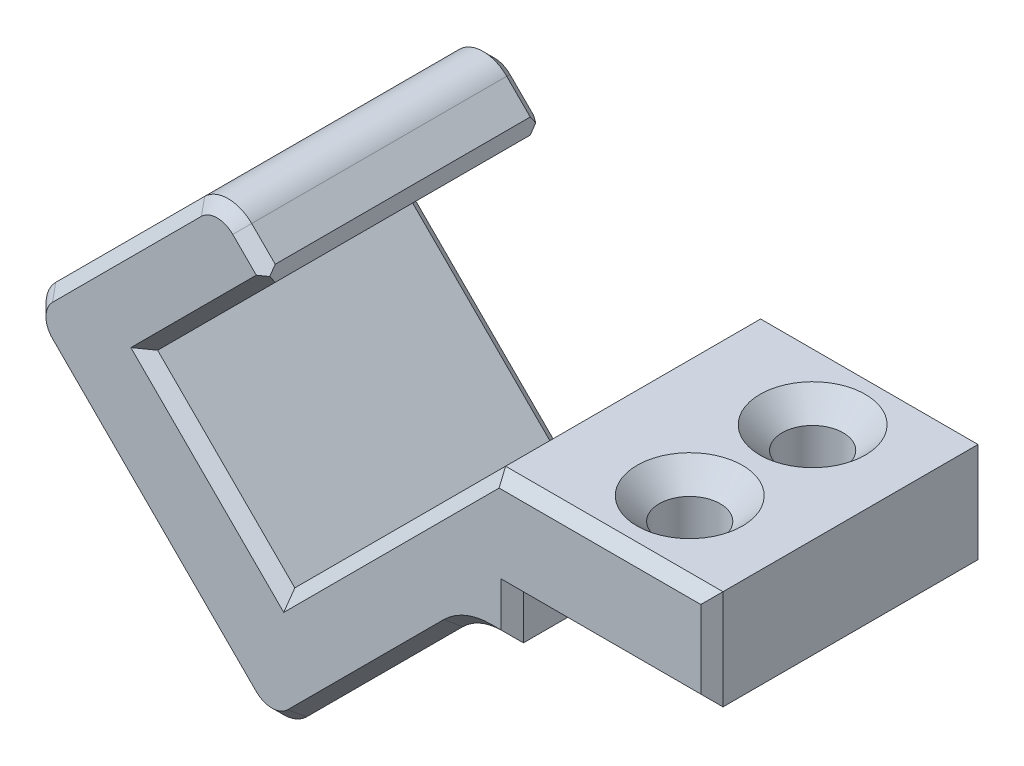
ISO-10303-21;
HEADER;
FILE_DESCRIPTION(('STEP AP214'),'2;1');
FILE_NAME('part.step','',(''),(''),'','','');
FILE_SCHEMA(('AUTOMOTIVE_DESIGN { 1 0 10303 214 1 1 1 1 }'));
ENDSEC;
DATA;
#1=APPLICATION_CONTEXT('core data for automotive mechanical design processes');
#2=APPLICATION_PROTOCOL_DEFINITION('international standard','automotive_design',2000,#1);
#3=PRODUCT_CONTEXT('',#1,'mechanical');
#4=PRODUCT('Part','Part','',(#3));
#5=PRODUCT_RELATED_PRODUCT_CATEGORY('part','',(#4));
#6=PRODUCT_DEFINITION_FORMATION('','',#4);
#7=PRODUCT_DEFINITION_CONTEXT('part definition',#1,'design');
#8=PRODUCT_DEFINITION('design','',#6,#7);
#9=PRODUCT_DEFINITION_SHAPE('','',#8);
#10=(LENGTH_UNIT() NAMED_UNIT(*) SI_UNIT(.MILLI.,.METRE.));
#11=(NAMED_UNIT(*) PLANE_ANGLE_UNIT() SI_UNIT($,.RADIAN.));
#12=(NAMED_UNIT(*) SI_UNIT($,.STERADIAN.) SOLID_ANGLE_UNIT());
#13=UNCERTAINTY_MEASURE_WITH_UNIT(LENGTH_MEASURE(1.E-05),#10,'distance_accuracy_value','');
#14=(GEOMETRIC_REPRESENTATION_CONTEXT(3) GLOBAL_UNCERTAINTY_ASSIGNED_CONTEXT((#13)) GLOBAL_UNIT_ASSIGNED_CONTEXT((#10,
#11,#12)) REPRESENTATION_CONTEXT('',''));
#15=CARTESIAN_POINT('',(0.,0.,0.));
#16=DIRECTION('',(0.,0.,1.));
#17=DIRECTION('',(1.,0.,0.));
#18=AXIS2_PLACEMENT_3D('',#15,#16,#17);
#19=CARTESIAN_POINT('',(4.36939174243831,19.0104076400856,25.));
#20=DIRECTION('',(0.,1.,0.));
#21=DIRECTION('',(0.,0.,1.));
#22=AXIS2_PLACEMENT_3D('',#19,#20,#21);
#23=PLANE('',#22);
#24=CARTESIAN_POINT('',(29.6170093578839,19.0104076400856,6.91363569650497));
#25=DIRECTION('',(0.,1.,0.));
#26=DIRECTION('',(0.,0.,1.));
#27=AXIS2_PLACEMENT_3D('',#24,#25,#26);
#28=CIRCLE('',#27,4.75000000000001);
#29=CARTESIAN_POINT('',(29.6170093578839,19.0104076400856,11.663635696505));
#30=VERTEX_POINT('',#29);
#31=EDGE_CURVE('E38',#30,#30,#28,.F.);
#32=ORIENTED_EDGE('',*,*,#31,.T.);
#33=EDGE_LOOP('',(#32));
#34=FACE_BOUND('',#33,.T.);
#35=CARTESIAN_POINT('',(29.6170093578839,19.0104076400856,18.));
#36=DIRECTION('',(0.,1.,0.));
#37=DIRECTION('',(0.,0.,1.));
#38=AXIS2_PLACEMENT_3D('',#35,#36,#37);
#39=CIRCLE('',#38,4.75000000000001);
#40=CARTESIAN_POINT('',(29.6170093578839,19.0104076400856,22.75));
#41=VERTEX_POINT('',#40);
#42=EDGE_CURVE('E498',#41,#41,#39,.F.);
#43=ORIENTED_EDGE('',*,*,#42,.T.);
#44=EDGE_LOOP('',(#43));
#45=FACE_BOUND('',#44,.T.);
#46=DIRECTION('',(0.,0.,-1.));
#47=VECTOR('',#46,1.);
#48=CARTESIAN_POINT('',(38.6170093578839,19.0104076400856,25.));
#49=LINE('',#48,#47);
#50=CARTESIAN_POINT('',(38.6170093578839,19.0104076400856,24.));
#51=VERTEX_POINT('',#50);
#52=CARTESIAN_POINT('',(38.6170093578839,19.0104076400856,1.));
#53=VERTEX_POINT('',#52);
#54=EDGE_CURVE('E360',#51,#53,#49,.T.);
#55=ORIENTED_EDGE('',*,*,#54,.T.);
#56=DIRECTION('',(-1.,0.,0.));
#57=VECTOR('',#56,1.);
#58=CARTESIAN_POINT('',(19.0104076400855,19.0104076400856,1.));
#59=LINE('',#58,#57);
#60=CARTESIAN_POINT('',(19.0104076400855,19.0104076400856,1.));
#61=VERTEX_POINT('',#60);
#62=EDGE_CURVE('E413',#53,#61,#59,.T.);
#63=ORIENTED_EDGE('',*,*,#62,.T.);
#64=DIRECTION('',(0.,0.,-1.));
#65=VECTOR('',#64,1.);
#66=CARTESIAN_POINT('',(19.0104076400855,19.0104076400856,25.));
#67=LINE('',#66,#65);
#68=CARTESIAN_POINT('',(19.0104076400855,19.0104076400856,24.));
#69=VERTEX_POINT('',#68);
#70=EDGE_CURVE('E578',#69,#61,#67,.T.);
#71=ORIENTED_EDGE('',*,*,#70,.F.);
#72=DIRECTION('',(1.,0.,0.));
#73=VECTOR('',#72,1.);
#74=CARTESIAN_POINT('',(4.36939174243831,19.0104076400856,24.));
#75=LINE('',#74,#73);
#76=EDGE_CURVE('E287',#69,#51,#75,.T.);
#77=ORIENTED_EDGE('',*,*,#76,.T.);
#78=EDGE_LOOP('',(#55,#63,#71,#77));
#79=FACE_BOUND('',#78,.T.);
#80=ADVANCED_FACE('F30',(#34,#45,#79),#23,.T.);
#81=CARTESIAN_POINT('',(-22.855910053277,-22.8559100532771,25.));
#82=DIRECTION('',(-0.70710678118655,0.707106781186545,0.));
#83=DIRECTION('',(-0.707106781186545,-0.70710678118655,0.));
#84=AXIS2_PLACEMENT_3D('',#81,#82,#83);
#85=PLANE('',#84);
#86=CARTESIAN_POINT('',(5.30330085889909,5.30330085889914,12.5));
#87=DIRECTION('',(-0.70710678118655,0.707106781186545,0.));
#88=DIRECTION('',(-0.707106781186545,-0.70710678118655,0.));
#89=AXIS2_PLACEMENT_3D('',#86,#87,#88);
#90=CIRCLE('',#89,1.75);
#91=CARTESIAN_POINT('',(4.06586399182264,4.06586399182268,12.5));
#92=VERTEX_POINT('',#91);
#93=EDGE_CURVE('E431',#92,#92,#90,.T.);
#94=ORIENTED_EDGE('',*,*,#93,.F.);
#95=EDGE_LOOP('',(#94));
#96=FACE_BOUND('',#95,.T.);
#97=ORIENTED_EDGE('',*,*,#70,.T.);
#98=DIRECTION('',(-0.707106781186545,-0.70710678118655,0.));
#99=VECTOR('',#98,1.);
#100=CARTESIAN_POINT('',(0.,0.,1.));
#101=LINE('',#100,#99);
#102=CARTESIAN_POINT('',(0.,0.,1.));
#103=VERTEX_POINT('',#102);
#104=EDGE_CURVE('E415',#61,#103,#101,.T.);
#105=ORIENTED_EDGE('',*,*,#104,.T.);
#106=DIRECTION('',(0.,0.,-1.));
#107=VECTOR('',#106,1.);
#108=CARTESIAN_POINT('',(0.,0.,25.));
#109=LINE('',#108,#107);
#110=CARTESIAN_POINT('',(0.,0.,24.));
#111=VERTEX_POINT('',#110);
#112=EDGE_CURVE('E575',#111,#103,#109,.T.);
#113=ORIENTED_EDGE('',*,*,#112,.F.);
#114=DIRECTION('',(0.707106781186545,0.70710678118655,0.));
#115=VECTOR('',#114,1.);
#116=CARTESIAN_POINT('',(-22.855910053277,-22.8559100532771,24.));
#117=LINE('',#116,#115);
#118=EDGE_CURVE('E285',#111,#69,#117,.T.);
#119=ORIENTED_EDGE('',*,*,#118,.T.);
#120=EDGE_LOOP('',(#97,#105,#113,#119));
#121=FACE_BOUND('',#120,.T.);
#122=ADVANCED_FACE('F706',(#96,#121),#85,.T.);
#123=CARTESIAN_POINT('',(27.2253017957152,-27.2253017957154,25.));
#124=DIRECTION('',(-0.70710678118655,-0.707106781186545,0.));
#125=DIRECTION('',(0.707106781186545,-0.70710678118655,0.));
#126=AXIS2_PLACEMENT_3D('',#123,#124,#125);
#127=PLANE('',#126);
#128=ORIENTED_EDGE('',*,*,#112,.T.);
#129=DIRECTION('',(-0.707106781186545,0.70710678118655,0.));
#130=VECTOR('',#129,1.);
#131=CARTESIAN_POINT('',(27.2253017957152,-27.2253017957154,0.999999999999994));
#132=LINE('',#131,#130);
#133=CARTESIAN_POINT('',(-12.3743686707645,12.3743686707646,1.));
#134=VERTEX_POINT('',#133);
#135=EDGE_CURVE('E417',#103,#134,#132,.T.);
#136=ORIENTED_EDGE('',*,*,#135,.T.);
#137=DIRECTION('',(0.,0.,-1.));
#138=VECTOR('',#137,1.);
#139=CARTESIAN_POINT('',(-12.3743686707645,12.3743686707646,25.));
#140=LINE('',#139,#138);
#141=CARTESIAN_POINT('',(-12.3743686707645,12.3743686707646,24.));
#142=VERTEX_POINT('',#141);
#143=EDGE_CURVE('E572',#142,#134,#140,.T.);
#144=ORIENTED_EDGE('',*,*,#143,.F.);
#145=DIRECTION('',(0.707106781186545,-0.70710678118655,0.));
#146=VECTOR('',#145,1.);
#147=CARTESIAN_POINT('',(0.,0.,24.));
#148=LINE('',#147,#146);
#149=EDGE_CURVE('E278',#142,#111,#148,.T.);
#150=ORIENTED_EDGE('',*,*,#149,.T.);
#151=EDGE_LOOP('',(#128,#136,#144,#150));
#152=FACE_BOUND('',#151,.T.);
#153=ADVANCED_FACE('F711',(#152),#127,.F.);
#154=CARTESIAN_POINT('',(-35.2302787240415,-10.4815413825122,25.));
#155=DIRECTION('',(-0.707106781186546,0.70710678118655,0.));
#156=DIRECTION('',(-0.70710678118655,-0.707106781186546,0.));
#157=AXIS2_PLACEMENT_3D('',#154,#155,#156);
#158=PLANE('',#157);
#159=DIRECTION('',(0.70710678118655,0.707106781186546,0.));
#160=VECTOR('',#159,1.);
#161=CARTESIAN_POINT('',(-35.2302787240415,-10.4815413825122,1.));
#162=LINE('',#161,#160);
#163=CARTESIAN_POINT('',(-1.76776695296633,22.9809703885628,1.));
#164=VERTEX_POINT('',#163);
#165=EDGE_CURVE('E419',#134,#164,#162,.T.);
#166=ORIENTED_EDGE('',*,*,#165,.T.);
#167=DIRECTION('',(0.,0.,1.));
#168=VECTOR('',#167,1.);
#169=CARTESIAN_POINT('',(-1.76776695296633,22.9809703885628,25.));
#170=LINE('',#169,#168);
#171=CARTESIAN_POINT('',(-1.76776695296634,22.9809703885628,24.));
#172=VERTEX_POINT('',#171);
#173=EDGE_CURVE('E53',#164,#172,#170,.T.);
#174=ORIENTED_EDGE('',*,*,#173,.T.);
#175=DIRECTION('',(-0.70710678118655,-0.707106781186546,0.));
#176=VECTOR('',#175,1.);
#177=CARTESIAN_POINT('',(-12.3743686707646,12.3743686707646,24.));
#178=LINE('',#177,#176);
#179=EDGE_CURVE('E276',#172,#142,#178,.T.);
#180=ORIENTED_EDGE('',*,*,#179,.T.);
#181=ORIENTED_EDGE('',*,*,#143,.T.);
#182=EDGE_LOOP('',(#166,#174,#180,#181));
#183=FACE_BOUND('',#182,.T.);
#184=ADVANCED_FACE('F1148',(#183),#158,.F.);
#185=CARTESIAN_POINT('',(38.5390102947,-15.9115932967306,25.));
#186=DIRECTION('',(-0.707106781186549,-0.707106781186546,0.));
#187=DIRECTION('',(0.707106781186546,-0.707106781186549,0.));
#188=AXIS2_PLACEMENT_3D('',#185,#186,#187);
#189=PLANE('',#188);
#190=DIRECTION('',(0.707106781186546,-0.707106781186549,0.));
#191=VECTOR('',#190,1.);
#192=CARTESIAN_POINT('',(-1.06066017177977,23.6880771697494,24.));
#193=LINE('',#192,#191);
#194=CARTESIAN_POINT('',(-3.88908729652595,26.5165042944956,24.));
#195=VERTEX_POINT('',#194);
#196=CARTESIAN_POINT('',(-1.76776695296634,24.3951839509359,24.));
#197=VERTEX_POINT('',#196);
#198=EDGE_CURVE('E315',#195,#197,#193,.T.);
#199=ORIENTED_EDGE('',*,*,#198,.T.);
#200=DIRECTION('',(0.,0.,-1.));
#201=VECTOR('',#200,1.);
#202=CARTESIAN_POINT('',(-1.76776695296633,24.3951839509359,25.));
#203=LINE('',#202,#201);
#204=CARTESIAN_POINT('',(-1.76776695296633,24.3951839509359,0.999999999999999));
#205=VERTEX_POINT('',#204);
#206=EDGE_CURVE('E427',#197,#205,#203,.T.);
#207=ORIENTED_EDGE('',*,*,#206,.T.);
#208=DIRECTION('',(-0.707106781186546,0.707106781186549,0.));
#209=VECTOR('',#208,1.);
#210=CARTESIAN_POINT('',(38.5390102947,-15.9115932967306,1.));
#211=LINE('',#210,#209);
#212=CARTESIAN_POINT('',(-3.88908729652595,26.5165042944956,1.));
#213=VERTEX_POINT('',#212);
#214=EDGE_CURVE('E421',#205,#213,#211,.T.);
#215=ORIENTED_EDGE('',*,*,#214,.T.);
#216=DIRECTION('',(0.,0.,-1.));
#217=VECTOR('',#216,1.);
#218=CARTESIAN_POINT('',(-3.88908729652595,26.5165042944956,25.));
#219=LINE('',#218,#217);
#220=EDGE_CURVE('E585',#213,#195,#219,.F.);
#221=ORIENTED_EDGE('',*,*,#220,.T.);
#222=EDGE_LOOP('',(#199,#207,#215,#221));
#223=FACE_BOUND('',#222,.T.);
#224=ADVANCED_FACE('F637',(#223),#189,.F.);
#225=CARTESIAN_POINT('',(-40.1800261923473,-5.53179391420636,25.));
#226=DIRECTION('',(0.707106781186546,-0.707106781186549,0.));
#227=DIRECTION('',(0.707106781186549,0.707106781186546,0.));
#228=AXIS2_PLACEMENT_3D('',#225,#226,#227);
#229=PLANE('',#228);
#230=DIRECTION('',(0.,0.,-1.));
#231=VECTOR('',#230,1.);
#232=CARTESIAN_POINT('',(-8.13172798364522,26.5165042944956,25.));
#233=LINE('',#232,#231);
#234=CARTESIAN_POINT('',(-8.13172798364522,26.5165042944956,24.));
#235=VERTEX_POINT('',#234);
#236=CARTESIAN_POINT('',(-8.13172798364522,26.5165042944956,1.));
#237=VERTEX_POINT('',#236);
#238=EDGE_CURVE('E582',#235,#237,#233,.T.);
#239=ORIENTED_EDGE('',*,*,#238,.T.);
#240=DIRECTION('',(-0.707106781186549,-0.707106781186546,0.));
#241=VECTOR('',#240,1.);
#242=CARTESIAN_POINT('',(-40.1800261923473,-5.53179391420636,1.));
#243=LINE('',#242,#241);
#244=CARTESIAN_POINT('',(-21.5667568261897,13.0814754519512,1.));
#245=VERTEX_POINT('',#244);
#246=EDGE_CURVE('E425',#237,#245,#243,.T.);
#247=ORIENTED_EDGE('',*,*,#246,.T.);
#248=DIRECTION('',(0.,0.,-1.));
#249=VECTOR('',#248,1.);
#250=CARTESIAN_POINT('',(-21.5667568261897,13.0814754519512,25.));
#251=LINE('',#250,#249);
#252=CARTESIAN_POINT('',(-21.5667568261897,13.0814754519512,24.));
#253=VERTEX_POINT('',#252);
#254=EDGE_CURVE('E580',#245,#253,#251,.F.);
#255=ORIENTED_EDGE('',*,*,#254,.T.);
#256=DIRECTION('',(0.707106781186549,0.707106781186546,0.));
#257=VECTOR('',#256,1.);
#258=CARTESIAN_POINT('',(-8.13172798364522,26.5165042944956,24.));
#259=LINE('',#258,#257);
#260=EDGE_CURVE('E310',#253,#235,#259,.T.);
#261=ORIENTED_EDGE('',*,*,#260,.T.);
#262=EDGE_LOOP('',(#239,#247,#255,#261));
#263=FACE_BOUND('',#262,.T.);
#264=ADVANCED_FACE('F1132',(#263),#229,.F.);
#265=CARTESIAN_POINT('',(20.8613407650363,-33.5892628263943,25.));
#266=DIRECTION('',(0.707106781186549,0.707106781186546,0.));
#267=DIRECTION('',(-0.707106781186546,0.707106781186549,0.));
#268=AXIS2_PLACEMENT_3D('',#265,#266,#267);
#269=PLANE('',#268);
#270=DIRECTION('',(0.,0.,-1.));
#271=VECTOR('',#270,1.);
#272=CARTESIAN_POINT('',(-21.5667568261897,8.83883476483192,25.));
#273=LINE('',#272,#271);
#274=CARTESIAN_POINT('',(-21.5667568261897,8.83883476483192,24.));
#275=VERTEX_POINT('',#274);
#276=CARTESIAN_POINT('',(-21.5667568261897,8.83883476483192,1.));
#277=VERTEX_POINT('',#276);
#278=EDGE_CURVE('E589',#275,#277,#273,.T.);
#279=ORIENTED_EDGE('',*,*,#278,.T.);
#280=DIRECTION('',(0.707106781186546,-0.707106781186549,0.));
#281=VECTOR('',#280,1.);
#282=CARTESIAN_POINT('',(20.8613407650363,-33.5892628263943,1.));
#283=LINE('',#282,#281);
#284=CARTESIAN_POINT('',(-3.18198051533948,-9.54594154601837,1.));
#285=VERTEX_POINT('',#284);
#286=EDGE_CURVE('E397',#277,#285,#283,.T.);
#287=ORIENTED_EDGE('',*,*,#286,.T.);
#288=DIRECTION('',(0.,0.,-1.));
#289=VECTOR('',#288,1.);
#290=CARTESIAN_POINT('',(-3.18198051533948,-9.54594154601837,25.));
#291=LINE('',#290,#289);
#292=CARTESIAN_POINT('',(-3.18198051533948,-9.54594154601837,24.));
#293=VERTEX_POINT('',#292);
#294=EDGE_CURVE('E587',#285,#293,#291,.F.);
#295=ORIENTED_EDGE('',*,*,#294,.T.);
#296=DIRECTION('',(-0.707106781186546,0.707106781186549,0.));
#297=VECTOR('',#296,1.);
#298=CARTESIAN_POINT('',(-21.5667568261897,8.83883476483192,24.));
#299=LINE('',#298,#297);
#300=EDGE_CURVE('E305',#293,#275,#299,.T.);
#301=ORIENTED_EDGE('',*,*,#300,.T.);
#302=EDGE_LOOP('',(#279,#287,#295,#301));
#303=FACE_BOUND('',#302,.T.);
#304=ADVANCED_FACE('F1123',(#303),#269,.F.);
#305=CARTESIAN_POINT('',(-17.5526091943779,-28.159210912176,25.));
#306=DIRECTION('',(-0.707106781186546,0.707106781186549,0.));
#307=DIRECTION('',(-0.707106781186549,-0.707106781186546,0.));
#308=AXIS2_PLACEMENT_3D('',#305,#306,#307);
#309=PLANE('',#308);
#310=CARTESIAN_POINT('',(10.6066017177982,0.,12.5));
#311=DIRECTION('',(-0.707106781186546,0.707106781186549,0.));
#312=DIRECTION('',(-0.707106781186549,-0.707106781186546,0.));
#313=AXIS2_PLACEMENT_3D('',#310,#311,#312);
#314=CIRCLE('',#313,3.75000000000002);
#315=CARTESIAN_POINT('',(7.95495128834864,-2.65165042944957,12.5));
#316=VERTEX_POINT('',#315);
#317=EDGE_CURVE('E486',#316,#316,#314,.T.);
#318=ORIENTED_EDGE('',*,*,#317,.T.);
#319=EDGE_LOOP('',(#318));
#320=FACE_BOUND('',#319,.T.);
#321=DIRECTION('',(0.,0.,-1.));
#322=VECTOR('',#321,1.);
#323=CARTESIAN_POINT('',(1.0606601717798,-9.54594154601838,25.));
#324=LINE('',#323,#322);
#325=CARTESIAN_POINT('',(1.0606601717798,-9.54594154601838,24.));
#326=VERTEX_POINT('',#325);
#327=CARTESIAN_POINT('',(1.0606601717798,-9.54594154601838,0.999999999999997));
#328=VERTEX_POINT('',#327);
#329=EDGE_CURVE('E592',#326,#328,#324,.T.);
#330=ORIENTED_EDGE('',*,*,#329,.T.);
#331=DIRECTION('',(0.707106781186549,0.707106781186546,0.));
#332=VECTOR('',#331,1.);
#333=CARTESIAN_POINT('',(-17.5526091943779,-28.159210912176,0.999999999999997));
#334=LINE('',#333,#332);
#335=CARTESIAN_POINT('',(15.1525432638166,4.54594154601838,1.));
#336=VERTEX_POINT('',#335);
#337=EDGE_CURVE('E401',#328,#336,#334,.T.);
#338=ORIENTED_EDGE('',*,*,#337,.T.);
#339=DIRECTION('',(0.,0.,-1.));
#340=VECTOR('',#339,1.);
#341=CARTESIAN_POINT('',(15.1525432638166,4.54594154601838,25.));
#342=LINE('',#341,#340);
#343=CARTESIAN_POINT('',(15.1525432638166,4.54594154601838,24.));
#344=VERTEX_POINT('',#343);
#345=EDGE_CURVE('E270',#336,#344,#342,.F.);
#346=ORIENTED_EDGE('',*,*,#345,.T.);
#347=DIRECTION('',(-0.707106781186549,-0.707106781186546,0.));
#348=VECTOR('',#347,1.);
#349=CARTESIAN_POINT('',(1.06066017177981,-9.54594154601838,24.));
#350=LINE('',#349,#348);
#351=EDGE_CURVE('E300',#344,#326,#350,.T.);
#352=ORIENTED_EDGE('',*,*,#351,.T.);
#353=EDGE_LOOP('',(#330,#338,#346,#352));
#354=FACE_BOUND('',#353,.T.);
#355=ADVANCED_FACE('F1114',(#320,#354),#309,.F.);
#356=CARTESIAN_POINT('',(4.36939174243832,6.01040764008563,25.));
#357=DIRECTION('',(0.,1.,0.));
#358=DIRECTION('',(-1.,0.,0.));
#359=AXIS2_PLACEMENT_3D('',#356,#357,#358);
#360=PLANE('',#359);
#361=DIRECTION('',(0.,0.,-1.));
#362=VECTOR('',#361,1.);
#363=CARTESIAN_POINT('',(18.6880771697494,6.01040764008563,0.));
#364=LINE('',#363,#362);
#365=CARTESIAN_POINT('',(18.6880771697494,6.01040764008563,24.));
#366=VERTEX_POINT('',#365);
#367=CARTESIAN_POINT('',(18.6880771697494,6.01040764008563,1.));
#368=VERTEX_POINT('',#367);
#369=EDGE_CURVE('E595',#366,#368,#364,.T.);
#370=ORIENTED_EDGE('',*,*,#369,.T.);
#371=DIRECTION('',(1.,0.,0.));
#372=VECTOR('',#371,1.);
#373=CARTESIAN_POINT('',(4.36939174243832,6.01040764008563,1.));
#374=LINE('',#373,#372);
#375=CARTESIAN_POINT('',(20.6170093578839,6.01040764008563,1.));
#376=VERTEX_POINT('',#375);
#377=EDGE_CURVE('E405',#368,#376,#374,.T.);
#378=ORIENTED_EDGE('',*,*,#377,.T.);
#379=DIRECTION('',(0.,0.,-1.));
#380=VECTOR('',#379,1.);
#381=CARTESIAN_POINT('',(20.6170093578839,6.01040764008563,25.));
#382=LINE('',#381,#380);
#383=CARTESIAN_POINT('',(20.6170093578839,6.01040764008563,24.));
#384=VERTEX_POINT('',#383);
#385=EDGE_CURVE('E534',#384,#376,#382,.T.);
#386=ORIENTED_EDGE('',*,*,#385,.F.);
#387=DIRECTION('',(-1.,0.,0.));
#388=VECTOR('',#387,1.);
#389=CARTESIAN_POINT('',(18.6880771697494,6.01040764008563,24.));
#390=LINE('',#389,#388);
#391=EDGE_CURVE('E295',#384,#366,#390,.T.);
#392=ORIENTED_EDGE('',*,*,#391,.T.);
#393=EDGE_LOOP('',(#370,#378,#386,#392));
#394=FACE_BOUND('',#393,.T.);
#395=ADVANCED_FACE('F1106',(#394),#360,.F.);
#396=CARTESIAN_POINT('',(20.6170093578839,-50.0812118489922,25.));
#397=DIRECTION('',(-1.,0.,0.));
#398=DIRECTION('',(0.,-1.,0.));
#399=AXIS2_PLACEMENT_3D('',#396,#397,#398);
#400=PLANE('',#399);
#401=ORIENTED_EDGE('',*,*,#385,.T.);
#402=DIRECTION('',(0.,1.,0.));
#403=VECTOR('',#402,1.);
#404=CARTESIAN_POINT('',(20.6170093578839,-50.0812118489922,1.));
#405=LINE('',#404,#403);
#406=CARTESIAN_POINT('',(20.6170093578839,10.0104076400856,1.));
#407=VERTEX_POINT('',#406);
#408=EDGE_CURVE('E407',#376,#407,#405,.T.);
#409=ORIENTED_EDGE('',*,*,#408,.T.);
#410=DIRECTION('',(0.,0.,-1.));
#411=VECTOR('',#410,1.);
#412=CARTESIAN_POINT('',(20.6170093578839,10.0104076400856,25.));
#413=LINE('',#412,#411);
#414=CARTESIAN_POINT('',(20.6170093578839,10.0104076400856,24.));
#415=VERTEX_POINT('',#414);
#416=EDGE_CURVE('E527',#415,#407,#413,.T.);
#417=ORIENTED_EDGE('',*,*,#416,.F.);
#418=DIRECTION('',(0.,-1.,0.));
#419=VECTOR('',#418,1.);
#420=CARTESIAN_POINT('',(20.6170093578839,6.01040764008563,24.));
#421=LINE('',#420,#419);
#422=EDGE_CURVE('E293',#415,#384,#421,.T.);
#423=ORIENTED_EDGE('',*,*,#422,.T.);
#424=EDGE_LOOP('',(#401,#409,#417,#423));
#425=FACE_BOUND('',#424,.T.);
#426=ADVANCED_FACE('F522',(#425),#400,.F.);
#427=CARTESIAN_POINT('',(4.36939174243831,10.0104076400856,25.));
#428=DIRECTION('',(0.,1.,0.));
#429=DIRECTION('',(-1.,0.,0.));
#430=AXIS2_PLACEMENT_3D('',#427,#428,#429);
#431=PLANE('',#430);
#432=CARTESIAN_POINT('',(29.6170093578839,10.0104076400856,18.));
#433=DIRECTION('',(0.,1.,0.));
#434=DIRECTION('',(-1.,0.,0.));
#435=AXIS2_PLACEMENT_3D('',#432,#433,#434);
#436=CIRCLE('',#435,2.75);
#437=CARTESIAN_POINT('',(26.8670093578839,10.0104076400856,18.));
#438=VERTEX_POINT('',#437);
#439=EDGE_CURVE('E493',#438,#438,#436,.T.);
#440=ORIENTED_EDGE('',*,*,#439,.T.);
#441=EDGE_LOOP('',(#440));
#442=FACE_BOUND('',#441,.T.);
#443=CARTESIAN_POINT('',(29.6170093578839,10.0104076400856,6.91363569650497));
#444=DIRECTION('',(0.,1.,0.));
#445=DIRECTION('',(-1.,0.,0.));
#446=AXIS2_PLACEMENT_3D('',#443,#444,#445);
#447=CIRCLE('',#446,2.75);
#448=CARTESIAN_POINT('',(26.8670093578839,10.0104076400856,6.91363569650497));
#449=VERTEX_POINT('',#448);
#450=EDGE_CURVE('E490',#449,#449,#447,.T.);
#451=ORIENTED_EDGE('',*,*,#450,.T.);
#452=EDGE_LOOP('',(#451));
#453=FACE_BOUND('',#452,.T.);
#454=ORIENTED_EDGE('',*,*,#416,.T.);
#455=DIRECTION('',(1.,0.,0.));
#456=VECTOR('',#455,1.);
#457=CARTESIAN_POINT('',(4.36939174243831,10.0104076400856,1.));
#458=LINE('',#457,#456);
#459=CARTESIAN_POINT('',(38.6170093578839,10.0104076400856,1.));
#460=VERTEX_POINT('',#459);
#461=EDGE_CURVE('E409',#407,#460,#458,.T.);
#462=ORIENTED_EDGE('',*,*,#461,.T.);
#463=DIRECTION('',(0.,0.,-1.));
#464=VECTOR('',#463,1.);
#465=CARTESIAN_POINT('',(38.6170093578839,10.0104076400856,25.));
#466=LINE('',#465,#464);
#467=CARTESIAN_POINT('',(38.6170093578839,10.0104076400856,24.));
#468=VERTEX_POINT('',#467);
#469=EDGE_CURVE('E535',#468,#460,#466,.T.);
#470=ORIENTED_EDGE('',*,*,#469,.F.);
#471=DIRECTION('',(-1.,0.,0.));
#472=VECTOR('',#471,1.);
#473=CARTESIAN_POINT('',(20.6170093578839,10.0104076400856,24.));
#474=LINE('',#473,#472);
#475=EDGE_CURVE('E291',#468,#415,#474,.T.);
#476=ORIENTED_EDGE('',*,*,#475,.T.);
#477=EDGE_LOOP('',(#454,#462,#470,#476));
#478=FACE_BOUND('',#477,.T.);
#479=ADVANCED_FACE('F518',(#442,#453,#478),#431,.F.);
#480=CARTESIAN_POINT('',(38.6170093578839,-50.0812118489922,25.));
#481=DIRECTION('',(-1.,0.,0.));
#482=DIRECTION('',(0.,-1.,0.));
#483=AXIS2_PLACEMENT_3D('',#480,#481,#482);
#484=PLANE('',#483);
#485=ORIENTED_EDGE('',*,*,#469,.T.);
#486=DIRECTION('',(0.,1.,0.));
#487=VECTOR('',#486,1.);
#488=CARTESIAN_POINT('',(38.6170093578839,-50.0812118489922,1.));
#489=LINE('',#488,#487);
#490=EDGE_CURVE('E411',#460,#53,#489,.T.);
#491=ORIENTED_EDGE('',*,*,#490,.T.);
#492=ORIENTED_EDGE('',*,*,#54,.F.);
#493=DIRECTION('',(0.,-1.,0.));
#494=VECTOR('',#493,1.);
#495=CARTESIAN_POINT('',(38.6170093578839,10.0104076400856,24.));
#496=LINE('',#495,#494);
#497=EDGE_CURVE('E289',#51,#468,#496,.T.);
#498=ORIENTED_EDGE('',*,*,#497,.T.);
#499=EDGE_LOOP('',(#485,#491,#492,#498));
#500=FACE_BOUND('',#499,.T.);
#501=ADVANCED_FACE('F521',(#500),#484,.F.);
#502=CARTESIAN_POINT('',(4.36939174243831,-50.0812118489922,25.));
#503=DIRECTION('',(0.,0.,1.));
#504=DIRECTION('',(1.,0.,0.));
#505=AXIS2_PLACEMENT_3D('',#502,#503,#504);
#506=PLANE('',#505);
#507=DIRECTION('',(-0.707106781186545,0.70710678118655,0.));
#508=VECTOR('',#507,1.);
#509=CARTESIAN_POINT('',(-13.0814754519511,11.6672618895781,25.));
#510=LINE('',#509,#508);
#511=CARTESIAN_POINT('',(0.,-1.41421356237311,25.));
#512=VERTEX_POINT('',#511);
#513=CARTESIAN_POINT('',(-13.7885822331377,12.3743686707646,25.));
#514=VERTEX_POINT('',#513);
#515=EDGE_CURVE('E274',#512,#514,#510,.T.);
#516=ORIENTED_EDGE('',*,*,#515,.T.);
#517=DIRECTION('',(0.70710678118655,0.707106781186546,0.));
#518=VECTOR('',#517,1.);
#519=CARTESIAN_POINT('',(-1.76776695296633,24.3951839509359,25.));
#520=LINE('',#519,#518);
#521=CARTESIAN_POINT('',(-2.47487373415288,23.6880771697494,25.));
#522=VERTEX_POINT('',#521);
#523=EDGE_CURVE('E255',#514,#522,#520,.T.);
#524=ORIENTED_EDGE('',*,*,#523,.T.);
#525=DIRECTION('',(-0.707106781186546,0.707106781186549,0.));
#526=VECTOR('',#525,1.);
#527=CARTESIAN_POINT('',(-4.59619407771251,25.809397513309,25.));
#528=LINE('',#527,#526);
#529=CARTESIAN_POINT('',(-4.59619407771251,25.809397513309,25.));
#530=VERTEX_POINT('',#529);
#531=EDGE_CURVE('E262',#522,#530,#528,.T.);
#532=ORIENTED_EDGE('',*,*,#531,.T.);
#533=CARTESIAN_POINT('',(-6.01040764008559,24.3951839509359,25.));
#534=DIRECTION('',(0.,0.,1.));
#535=DIRECTION('',(1.,0.,0.));
#536=AXIS2_PLACEMENT_3D('',#533,#534,#535);
#537=CIRCLE('',#536,1.99999999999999);
#538=CARTESIAN_POINT('',(-7.42462120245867,25.809397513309,25.));
#539=VERTEX_POINT('',#538);
#540=EDGE_CURVE('E269',#530,#539,#537,.T.);
#541=ORIENTED_EDGE('',*,*,#540,.T.);
#542=DIRECTION('',(-0.707106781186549,-0.707106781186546,0.));
#543=VECTOR('',#542,1.);
#544=CARTESIAN_POINT('',(-20.8596500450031,12.3743686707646,25.));
#545=LINE('',#544,#543);
#546=CARTESIAN_POINT('',(-20.8596500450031,12.3743686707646,25.));
#547=VERTEX_POINT('',#546);
#548=EDGE_CURVE('E600',#539,#547,#545,.T.);
#549=ORIENTED_EDGE('',*,*,#548,.T.);
#550=CARTESIAN_POINT('',(-19.44543648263,10.9601551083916,25.));
#551=DIRECTION('',(0.,0.,1.));
#552=DIRECTION('',(1.,0.,0.));
#553=AXIS2_PLACEMENT_3D('',#550,#551,#552);
#554=CIRCLE('',#553,1.99999999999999);
#555=CARTESIAN_POINT('',(-20.8596500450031,9.54594154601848,25.));
#556=VERTEX_POINT('',#555);
#557=EDGE_CURVE('E602',#547,#556,#554,.T.);
#558=ORIENTED_EDGE('',*,*,#557,.T.);
#559=DIRECTION('',(0.707106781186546,-0.707106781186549,0.));
#560=VECTOR('',#559,1.);
#561=CARTESIAN_POINT('',(-2.47487373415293,-8.83883476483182,25.));
#562=LINE('',#561,#560);
#563=CARTESIAN_POINT('',(-2.47487373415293,-8.83883476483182,25.));
#564=VERTEX_POINT('',#563);
#565=EDGE_CURVE('E604',#556,#564,#562,.T.);
#566=ORIENTED_EDGE('',*,*,#565,.T.);
#567=CARTESIAN_POINT('',(-1.06066017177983,-7.42462120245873,25.));
#568=DIRECTION('',(0.,0.,1.));
#569=DIRECTION('',(1.,0.,0.));
#570=AXIS2_PLACEMENT_3D('',#567,#568,#569);
#571=CIRCLE('',#570,1.99999999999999);
#572=CARTESIAN_POINT('',(0.353553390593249,-8.83883476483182,25.));
#573=VERTEX_POINT('',#572);
#574=EDGE_CURVE('E606',#564,#573,#571,.T.);
#575=ORIENTED_EDGE('',*,*,#574,.T.);
#576=DIRECTION('',(0.707106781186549,0.707106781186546,0.));
#577=VECTOR('',#576,1.);
#578=CARTESIAN_POINT('',(14.4454364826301,5.25304832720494,25.));
#579=LINE('',#578,#577);
#580=CARTESIAN_POINT('',(14.4454364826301,5.25304832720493,25.));
#581=VERTEX_POINT('',#580);
#582=EDGE_CURVE('E608',#573,#581,#579,.T.);
#583=ORIENTED_EDGE('',*,*,#582,.T.);
#584=CARTESIAN_POINT('',(18.6880771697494,1.01040764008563,25.));
#585=DIRECTION('',(0.,0.,1.));
#586=DIRECTION('',(1.,0.,0.));
#587=AXIS2_PLACEMENT_3D('',#584,#585,#586);
#588=CIRCLE('',#587,6.00000000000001);
#589=CARTESIAN_POINT('',(18.6880771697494,7.01040764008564,25.));
#590=VERTEX_POINT('',#589);
#591=EDGE_CURVE('E610',#581,#590,#588,.F.);
#592=ORIENTED_EDGE('',*,*,#591,.T.);
#593=DIRECTION('',(1.,0.,0.));
#594=VECTOR('',#593,1.);
#595=CARTESIAN_POINT('',(20.6170093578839,7.01040764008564,25.));
#596=LINE('',#595,#594);
#597=CARTESIAN_POINT('',(19.6170093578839,7.01040764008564,25.));
#598=VERTEX_POINT('',#597);
#599=EDGE_CURVE('E612',#590,#598,#596,.T.);
#600=ORIENTED_EDGE('',*,*,#599,.T.);
#601=DIRECTION('',(0.,1.,0.));
#602=VECTOR('',#601,1.);
#603=CARTESIAN_POINT('',(19.6170093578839,10.0104076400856,25.));
#604=LINE('',#603,#602);
#605=CARTESIAN_POINT('',(19.6170093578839,11.0104076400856,25.));
#606=VERTEX_POINT('',#605);
#607=EDGE_CURVE('E614',#598,#606,#604,.T.);
#608=ORIENTED_EDGE('',*,*,#607,.T.);
#609=DIRECTION('',(1.,0.,0.));
#610=VECTOR('',#609,1.);
#611=CARTESIAN_POINT('',(38.6170093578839,11.0104076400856,25.));
#612=LINE('',#611,#610);
#613=CARTESIAN_POINT('',(37.6170093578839,11.0104076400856,25.));
#614=VERTEX_POINT('',#613);
#615=EDGE_CURVE('E616',#606,#614,#612,.T.);
#616=ORIENTED_EDGE('',*,*,#615,.T.);
#617=DIRECTION('',(0.,1.,0.));
#618=VECTOR('',#617,1.);
#619=CARTESIAN_POINT('',(37.6170093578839,19.0104076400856,25.));
#620=LINE('',#619,#618);
#621=CARTESIAN_POINT('',(37.6170093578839,18.0104076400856,25.));
#622=VERTEX_POINT('',#621);
#623=EDGE_CURVE('E618',#614,#622,#620,.T.);
#624=ORIENTED_EDGE('',*,*,#623,.T.);
#625=DIRECTION('',(-1.,0.,0.));
#626=VECTOR('',#625,1.);
#627=CARTESIAN_POINT('',(4.36939174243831,18.0104076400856,25.));
#628=LINE('',#627,#626);
#629=CARTESIAN_POINT('',(19.4246212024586,18.0104076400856,25.));
#630=VERTEX_POINT('',#629);
#631=EDGE_CURVE('E620',#622,#630,#628,.T.);
#632=ORIENTED_EDGE('',*,*,#631,.T.);
#633=DIRECTION('',(-0.707106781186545,-0.70710678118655,0.));
#634=VECTOR('',#633,1.);
#635=CARTESIAN_POINT('',(-22.1488032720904,-23.5630168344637,25.));
#636=LINE('',#635,#634);
#637=EDGE_CURVE('E280',#630,#512,#636,.T.);
#638=ORIENTED_EDGE('',*,*,#637,.T.);
#639=EDGE_LOOP('',(#516,#524,#532,#541,#549,#558,#566,#575,#583,#592,#600,#608,#616,#624,#632,#638));
#640=FACE_BOUND('',#639,.T.);
#641=ADVANCED_FACE('F272',(#640),#506,.T.);
#642=CARTESIAN_POINT('',(4.36939174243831,-50.0812118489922,0.));
#643=DIRECTION('',(0.,0.,1.));
#644=DIRECTION('',(1.,0.,0.));
#645=AXIS2_PLACEMENT_3D('',#642,#643,#644);
#646=PLANE('',#645);
#647=DIRECTION('',(-0.707106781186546,0.707106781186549,0.));
#648=VECTOR('',#647,1.);
#649=CARTESIAN_POINT('',(21.5684475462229,-32.8821560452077,0.));
#650=LINE('',#649,#648);
#651=CARTESIAN_POINT('',(-2.47487373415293,-8.83883476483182,0.));
#652=VERTEX_POINT('',#651);
#653=CARTESIAN_POINT('',(-20.8596500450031,9.54594154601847,0.));
#654=VERTEX_POINT('',#653);
#655=EDGE_CURVE('E389',#652,#654,#650,.T.);
#656=ORIENTED_EDGE('',*,*,#655,.T.);
#657=CARTESIAN_POINT('',(-19.44543648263,10.9601551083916,0.));
#658=DIRECTION('',(0.,0.,1.));
#659=DIRECTION('',(1.,0.,0.));
#660=AXIS2_PLACEMENT_3D('',#657,#658,#659);
#661=CIRCLE('',#660,1.99999999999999);
#662=CARTESIAN_POINT('',(-20.8596500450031,12.3743686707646,0.));
#663=VERTEX_POINT('',#662);
#664=EDGE_CURVE('E391',#654,#663,#661,.F.);
#665=ORIENTED_EDGE('',*,*,#664,.T.);
#666=DIRECTION('',(0.707106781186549,0.707106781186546,0.));
#667=VECTOR('',#666,1.);
#668=CARTESIAN_POINT('',(-39.4729194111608,-6.23890069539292,0.));
#669=LINE('',#668,#667);
#670=CARTESIAN_POINT('',(-7.42462120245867,25.809397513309,0.));
#671=VERTEX_POINT('',#670);
#672=EDGE_CURVE('E317',#663,#671,#669,.T.);
#673=ORIENTED_EDGE('',*,*,#672,.T.);
#674=CARTESIAN_POINT('',(-6.01040764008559,24.3951839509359,0.));
#675=DIRECTION('',(0.,0.,1.));
#676=DIRECTION('',(1.,0.,0.));
#677=AXIS2_PLACEMENT_3D('',#674,#675,#676);
#678=CIRCLE('',#677,1.99999999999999);
#679=CARTESIAN_POINT('',(-4.5961940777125,25.809397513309,0.));
#680=VERTEX_POINT('',#679);
#681=EDGE_CURVE('E362',#671,#680,#678,.F.);
#682=ORIENTED_EDGE('',*,*,#681,.T.);
#683=DIRECTION('',(0.707106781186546,-0.707106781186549,0.));
#684=VECTOR('',#683,1.);
#685=CARTESIAN_POINT('',(37.8319035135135,-16.6187000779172,0.));
#686=LINE('',#685,#684);
#687=CARTESIAN_POINT('',(-2.47487373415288,23.6880771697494,0.));
#688=VERTEX_POINT('',#687);
#689=EDGE_CURVE('E364',#680,#688,#686,.T.);
#690=ORIENTED_EDGE('',*,*,#689,.T.);
#691=DIRECTION('',(-0.70710678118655,-0.707106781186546,0.));
#692=VECTOR('',#691,1.);
#693=CARTESIAN_POINT('',(-35.9373855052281,-9.77443460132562,0.));
#694=LINE('',#693,#692);
#695=CARTESIAN_POINT('',(-13.7885822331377,12.3743686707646,0.));
#696=VERTEX_POINT('',#695);
#697=EDGE_CURVE('E367',#688,#696,#694,.T.);
#698=ORIENTED_EDGE('',*,*,#697,.T.);
#699=DIRECTION('',(0.707106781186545,-0.70710678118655,0.));
#700=VECTOR('',#699,1.);
#701=CARTESIAN_POINT('',(26.5181950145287,-27.932408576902,0.));
#702=LINE('',#701,#700);
#703=CARTESIAN_POINT('',(0.,-1.41421356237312,0.));
#704=VERTEX_POINT('',#703);
#705=EDGE_CURVE('E369',#696,#704,#702,.T.);
#706=ORIENTED_EDGE('',*,*,#705,.T.);
#707=DIRECTION('',(0.707106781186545,0.70710678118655,0.));
#708=VECTOR('',#707,1.);
#709=CARTESIAN_POINT('',(19.717514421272,18.3033008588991,0.));
#710=LINE('',#709,#708);
#711=CARTESIAN_POINT('',(19.4246212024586,18.0104076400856,0.));
#712=VERTEX_POINT('',#711);
#713=EDGE_CURVE('E371',#704,#712,#710,.T.);
#714=ORIENTED_EDGE('',*,*,#713,.T.);
#715=DIRECTION('',(1.,0.,0.));
#716=VECTOR('',#715,1.);
#717=CARTESIAN_POINT('',(38.6170093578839,18.0104076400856,0.));
#718=LINE('',#717,#716);
#719=CARTESIAN_POINT('',(37.6170093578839,18.0104076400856,0.));
#720=VERTEX_POINT('',#719);
#721=EDGE_CURVE('E373',#712,#720,#718,.T.);
#722=ORIENTED_EDGE('',*,*,#721,.T.);
#723=DIRECTION('',(0.,-1.,0.));
#724=VECTOR('',#723,1.);
#725=CARTESIAN_POINT('',(37.6170093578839,-50.0812118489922,0.));
#726=LINE('',#725,#724);
#727=CARTESIAN_POINT('',(37.6170093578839,11.0104076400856,0.));
#728=VERTEX_POINT('',#727);
#729=EDGE_CURVE('E375',#720,#728,#726,.T.);
#730=ORIENTED_EDGE('',*,*,#729,.T.);
#731=DIRECTION('',(-1.,0.,0.));
#732=VECTOR('',#731,1.);
#733=CARTESIAN_POINT('',(4.36939174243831,11.0104076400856,0.));
#734=LINE('',#733,#732);
#735=CARTESIAN_POINT('',(19.6170093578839,11.0104076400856,0.));
#736=VERTEX_POINT('',#735);
#737=EDGE_CURVE('E377',#728,#736,#734,.T.);
#738=ORIENTED_EDGE('',*,*,#737,.T.);
#739=DIRECTION('',(0.,-1.,0.));
#740=VECTOR('',#739,1.);
#741=CARTESIAN_POINT('',(19.6170093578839,-50.0812118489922,0.));
#742=LINE('',#741,#740);
#743=CARTESIAN_POINT('',(19.6170093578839,7.01040764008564,0.));
#744=VERTEX_POINT('',#743);
#745=EDGE_CURVE('E379',#736,#744,#742,.T.);
#746=ORIENTED_EDGE('',*,*,#745,.T.);
#747=DIRECTION('',(-1.,0.,0.));
#748=VECTOR('',#747,1.);
#749=CARTESIAN_POINT('',(4.36939174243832,7.01040764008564,0.));
#750=LINE('',#749,#748);
#751=CARTESIAN_POINT('',(18.6880771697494,7.01040764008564,0.));
#752=VERTEX_POINT('',#751);
#753=EDGE_CURVE('E381',#744,#752,#750,.T.);
#754=ORIENTED_EDGE('',*,*,#753,.T.);
#755=CARTESIAN_POINT('',(18.6880771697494,1.01040764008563,0.));
#756=DIRECTION('',(0.,0.,1.));
#757=DIRECTION('',(1.,0.,0.));
#758=AXIS2_PLACEMENT_3D('',#755,#756,#757);
#759=CIRCLE('',#758,6.00000000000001);
#760=CARTESIAN_POINT('',(14.4454364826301,5.25304832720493,0.));
#761=VERTEX_POINT('',#760);
#762=EDGE_CURVE('E383',#752,#761,#759,.T.);
#763=ORIENTED_EDGE('',*,*,#762,.T.);
#764=DIRECTION('',(-0.707106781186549,-0.707106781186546,0.));
#765=VECTOR('',#764,1.);
#766=CARTESIAN_POINT('',(-18.2597159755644,-27.4521041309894,0.));
#767=LINE('',#766,#765);
#768=CARTESIAN_POINT('',(0.353553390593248,-8.83883476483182,0.));
#769=VERTEX_POINT('',#768);
#770=EDGE_CURVE('E385',#761,#769,#767,.T.);
#771=ORIENTED_EDGE('',*,*,#770,.T.);
#772=CARTESIAN_POINT('',(-1.06066017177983,-7.42462120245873,0.));
#773=DIRECTION('',(0.,0.,1.));
#774=DIRECTION('',(1.,0.,0.));
#775=AXIS2_PLACEMENT_3D('',#772,#773,#774);
#776=CIRCLE('',#775,1.99999999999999);
#777=EDGE_CURVE('E387',#769,#652,#776,.F.);
#778=ORIENTED_EDGE('',*,*,#777,.T.);
#779=EDGE_LOOP('',(#656,#665,#673,#682,#690,#698,#706,#714,#722,#730,#738,#746,#754,#763,#771,#778));
#780=FACE_BOUND('',#779,.T.);
#781=ADVANCED_FACE('F549',(#780),#646,.F.);
#782=CARTESIAN_POINT('',(-6.01040764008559,24.3951839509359,25.));
#783=DIRECTION('',(0.,0.,-1.));
#784=DIRECTION('',(-1.,0.,0.));
#785=AXIS2_PLACEMENT_3D('',#782,#783,#784);
#786=CYLINDRICAL_SURFACE('',#785,3.);
#787=ORIENTED_EDGE('',*,*,#220,.F.);
#788=CARTESIAN_POINT('',(-6.01040764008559,24.3951839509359,1.));
#789=DIRECTION('',(0.,0.,1.));
#790=DIRECTION('',(1.,0.,0.));
#791=AXIS2_PLACEMENT_3D('',#788,#789,#790);
#792=CIRCLE('',#791,3.);
#793=EDGE_CURVE('E423',#213,#237,#792,.T.);
#794=ORIENTED_EDGE('',*,*,#793,.T.);
#795=ORIENTED_EDGE('',*,*,#238,.F.);
#796=CARTESIAN_POINT('',(-6.01040764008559,24.3951839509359,24.));
#797=DIRECTION('',(0.,0.,1.));
#798=DIRECTION('',(1.,0.,0.));
#799=AXIS2_PLACEMENT_3D('',#796,#797,#798);
#800=CIRCLE('',#799,3.);
#801=EDGE_CURVE('E312',#235,#195,#800,.F.);
#802=ORIENTED_EDGE('',*,*,#801,.T.);
#803=EDGE_LOOP('',(#787,#794,#795,#802));
#804=FACE_BOUND('',#803,.T.);
#805=ADVANCED_FACE('F644',(#804),#786,.T.);
#806=CARTESIAN_POINT('',(-19.44543648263,10.9601551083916,25.));
#807=DIRECTION('',(0.,0.,-1.));
#808=DIRECTION('',(-1.,0.,0.));
#809=AXIS2_PLACEMENT_3D('',#806,#807,#808);
#810=CYLINDRICAL_SURFACE('',#809,3.);
#811=ORIENTED_EDGE('',*,*,#254,.F.);
#812=CARTESIAN_POINT('',(-19.44543648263,10.9601551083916,1.));
#813=DIRECTION('',(0.,0.,1.));
#814=DIRECTION('',(1.,0.,0.));
#815=AXIS2_PLACEMENT_3D('',#812,#813,#814);
#816=CIRCLE('',#815,3.);
#817=EDGE_CURVE('E394',#245,#277,#816,.T.);
#818=ORIENTED_EDGE('',*,*,#817,.T.);
#819=ORIENTED_EDGE('',*,*,#278,.F.);
#820=CARTESIAN_POINT('',(-19.44543648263,10.9601551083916,24.));
#821=DIRECTION('',(0.,0.,1.));
#822=DIRECTION('',(1.,0.,0.));
#823=AXIS2_PLACEMENT_3D('',#820,#821,#822);
#824=CIRCLE('',#823,3.);
#825=EDGE_CURVE('E307',#275,#253,#824,.F.);
#826=ORIENTED_EDGE('',*,*,#825,.T.);
#827=EDGE_LOOP('',(#811,#818,#819,#826));
#828=FACE_BOUND('',#827,.T.);
#829=ADVANCED_FACE('F718',(#828),#810,.T.);
#830=CARTESIAN_POINT('',(-1.06066017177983,-7.42462120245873,25.));
#831=DIRECTION('',(0.,0.,-1.));
#832=DIRECTION('',(-1.,0.,0.));
#833=AXIS2_PLACEMENT_3D('',#830,#831,#832);
#834=CYLINDRICAL_SURFACE('',#833,3.);
#835=ORIENTED_EDGE('',*,*,#294,.F.);
#836=CARTESIAN_POINT('',(-1.06066017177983,-7.42462120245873,1.));
#837=DIRECTION('',(0.,0.,1.));
#838=DIRECTION('',(1.,0.,0.));
#839=AXIS2_PLACEMENT_3D('',#836,#837,#838);
#840=CIRCLE('',#839,3.);
#841=EDGE_CURVE('E399',#285,#328,#840,.T.);
#842=ORIENTED_EDGE('',*,*,#841,.T.);
#843=ORIENTED_EDGE('',*,*,#329,.F.);
#844=CARTESIAN_POINT('',(-1.06066017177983,-7.42462120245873,24.));
#845=DIRECTION('',(0.,0.,1.));
#846=DIRECTION('',(1.,0.,0.));
#847=AXIS2_PLACEMENT_3D('',#844,#845,#846);
#848=CIRCLE('',#847,3.);
#849=EDGE_CURVE('E302',#326,#293,#848,.F.);
#850=ORIENTED_EDGE('',*,*,#849,.T.);
#851=EDGE_LOOP('',(#835,#842,#843,#850));
#852=FACE_BOUND('',#851,.T.);
#853=ADVANCED_FACE('F721',(#852),#834,.T.);
#854=CARTESIAN_POINT('',(18.6880771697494,1.01040764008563,25.));
#855=DIRECTION('',(0.,0.,1.));
#856=DIRECTION('',(1.,0.,0.));
#857=AXIS2_PLACEMENT_3D('',#854,#855,#856);
#858=CYLINDRICAL_SURFACE('',#857,5.);
#859=ORIENTED_EDGE('',*,*,#345,.F.);
#860=CARTESIAN_POINT('',(18.6880771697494,1.01040764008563,1.));
#861=DIRECTION('',(0.,0.,1.));
#862=DIRECTION('',(1.,0.,0.));
#863=AXIS2_PLACEMENT_3D('',#860,#861,#862);
#864=CIRCLE('',#863,5.);
#865=EDGE_CURVE('E403',#336,#368,#864,.F.);
#866=ORIENTED_EDGE('',*,*,#865,.T.);
#867=ORIENTED_EDGE('',*,*,#369,.F.);
#868=CARTESIAN_POINT('',(18.6880771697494,1.01040764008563,24.));
#869=DIRECTION('',(0.,0.,1.));
#870=DIRECTION('',(1.,0.,0.));
#871=AXIS2_PLACEMENT_3D('',#868,#869,#870);
#872=CIRCLE('',#871,5.);
#873=EDGE_CURVE('E297',#366,#344,#872,.T.);
#874=ORIENTED_EDGE('',*,*,#873,.T.);
#875=EDGE_LOOP('',(#859,#866,#867,#874));
#876=FACE_BOUND('',#875,.T.);
#877=ADVANCED_FACE('F725',(#876),#858,.F.);
#878=CARTESIAN_POINT('',(18.6880771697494,1.01040764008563,25.));
#879=DIRECTION('',(0.,0.,1.));
#880=DIRECTION('',(1.,0.,0.));
#881=AXIS2_PLACEMENT_3D('',#878,#879,#880);
#882=CONICAL_SURFACE('',#881,6.00000000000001,0.785398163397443);
#883=DIRECTION('',(-0.499999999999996,0.499999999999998,0.707106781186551));
#884=VECTOR('',#883,1.);
#885=CARTESIAN_POINT('',(15.1525432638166,4.54594154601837,24.));
#886=LINE('',#885,#884);
#887=EDGE_CURVE('E354',#344,#581,#886,.T.);
#888=ORIENTED_EDGE('',*,*,#887,.F.);
#889=ORIENTED_EDGE('',*,*,#873,.F.);
#890=DIRECTION('',(0.,-0.707106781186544,-0.707106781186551));
#891=VECTOR('',#890,1.);
#892=CARTESIAN_POINT('',(18.6880771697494,7.01040764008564,25.));
#893=LINE('',#892,#891);
#894=EDGE_CURVE('E357',#590,#366,#893,.T.);
#895=ORIENTED_EDGE('',*,*,#894,.F.);
#896=ORIENTED_EDGE('',*,*,#591,.F.);
#897=EDGE_LOOP('',(#888,#889,#895,#896));
#898=FACE_BOUND('',#897,.T.);
#899=ADVANCED_FACE('F676',(#898),#882,.F.);
#900=CARTESIAN_POINT('',(4.36939174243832,7.01040764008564,25.));
#901=DIRECTION('',(0.,-0.707106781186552,0.707106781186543));
#902=DIRECTION('',(0.,-0.707106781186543,-0.707106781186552));
#903=AXIS2_PLACEMENT_3D('',#900,#901,#902);
#904=PLANE('',#903);
#905=ORIENTED_EDGE('',*,*,#894,.T.);
#906=ORIENTED_EDGE('',*,*,#391,.F.);
#907=DIRECTION('',(-0.577350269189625,0.577350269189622,0.57735026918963));
#908=VECTOR('',#907,1.);
#909=CARTESIAN_POINT('',(14.5344701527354,12.0929468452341,30.0825392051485));
#910=LINE('',#909,#908);
#911=EDGE_CURVE('E351',#598,#384,#910,.F.);
#912=ORIENTED_EDGE('',*,*,#911,.F.);
#913=ORIENTED_EDGE('',*,*,#599,.F.);
#914=EDGE_LOOP('',(#905,#906,#912,#913));
#915=FACE_BOUND('',#914,.T.);
#916=ADVANCED_FACE('F684',(#915),#904,.T.);
#917=CARTESIAN_POINT('',(-18.2597159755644,-27.4521041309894,25.));
#918=DIRECTION('',(0.500000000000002,-0.500000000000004,0.707106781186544));
#919=DIRECTION('',(0.,-0.816496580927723,-0.577350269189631));
#920=AXIS2_PLACEMENT_3D('',#917,#918,#919);
#921=PLANE('',#920);
#922=ORIENTED_EDGE('',*,*,#887,.T.);
#923=ORIENTED_EDGE('',*,*,#582,.F.);
#924=DIRECTION('',(-0.499999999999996,0.499999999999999,0.70710678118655));
#925=VECTOR('',#924,1.);
#926=CARTESIAN_POINT('',(1.0606601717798,-9.54594154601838,24.));
#927=LINE('',#926,#925);
#928=EDGE_CURVE('E348',#326,#573,#927,.T.);
#929=ORIENTED_EDGE('',*,*,#928,.F.);
#930=ORIENTED_EDGE('',*,*,#351,.F.);
#931=EDGE_LOOP('',(#922,#923,#929,#930));
#932=FACE_BOUND('',#931,.T.);
#933=ADVANCED_FACE('F671',(#932),#921,.T.);
#934=CARTESIAN_POINT('',(19.6170093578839,-50.0812118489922,25.));
#935=DIRECTION('',(0.707106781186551,0.,0.707106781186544));
#936=DIRECTION('',(0.707106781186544,0.,-0.707106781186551));
#937=AXIS2_PLACEMENT_3D('',#934,#935,#936);
#938=PLANE('',#937);
#939=ORIENTED_EDGE('',*,*,#911,.T.);
#940=ORIENTED_EDGE('',*,*,#422,.F.);
#941=DIRECTION('',(-0.577350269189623,0.577350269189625,0.577350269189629));
#942=VECTOR('',#941,1.);
#943=CARTESIAN_POINT('',(14.5344701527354,16.0929468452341,30.0825392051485));
#944=LINE('',#943,#942);
#945=EDGE_CURVE('E345',#606,#415,#944,.F.);
#946=ORIENTED_EDGE('',*,*,#945,.F.);
#947=ORIENTED_EDGE('',*,*,#607,.F.);
#948=EDGE_LOOP('',(#939,#940,#946,#947));
#949=FACE_BOUND('',#948,.T.);
#950=ADVANCED_FACE('F686',(#949),#938,.T.);
#951=CARTESIAN_POINT('',(-1.06066017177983,-7.42462120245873,25.));
#952=DIRECTION('',(0.,0.,-1.));
#953=DIRECTION('',(-1.,0.,0.));
#954=AXIS2_PLACEMENT_3D('',#951,#952,#953);
#955=CONICAL_SURFACE('',#954,1.99999999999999,0.785398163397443);
#956=ORIENTED_EDGE('',*,*,#928,.T.);
#957=ORIENTED_EDGE('',*,*,#574,.F.);
#958=DIRECTION('',(0.499999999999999,0.499999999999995,0.707106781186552));
#959=VECTOR('',#958,1.);
#960=CARTESIAN_POINT('',(-3.18198051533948,-9.54594154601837,24.));
#961=LINE('',#960,#959);
#962=EDGE_CURVE('E342',#293,#564,#961,.T.);
#963=ORIENTED_EDGE('',*,*,#962,.F.);
#964=ORIENTED_EDGE('',*,*,#849,.F.);
#965=EDGE_LOOP('',(#956,#957,#963,#964));
#966=FACE_BOUND('',#965,.T.);
#967=ADVANCED_FACE('F666',(#966),#955,.T.);
#968=CARTESIAN_POINT('',(4.36939174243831,11.0104076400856,25.));
#969=DIRECTION('',(0.,-0.70710678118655,0.707106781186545));
#970=DIRECTION('',(0.,-0.707106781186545,-0.70710678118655));
#971=AXIS2_PLACEMENT_3D('',#968,#969,#970);
#972=PLANE('',#971);
#973=ORIENTED_EDGE('',*,*,#945,.T.);
#974=ORIENTED_EDGE('',*,*,#475,.F.);
#975=DIRECTION('',(-0.577350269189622,0.577350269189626,0.57735026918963));
#976=VECTOR('',#975,1.);
#977=CARTESIAN_POINT('',(26.5344701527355,22.0929468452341,36.0825392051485));
#978=LINE('',#977,#976);
#979=EDGE_CURVE('E339',#614,#468,#978,.F.);
#980=ORIENTED_EDGE('',*,*,#979,.F.);
#981=ORIENTED_EDGE('',*,*,#615,.F.);
#982=EDGE_LOOP('',(#973,#974,#980,#981));
#983=FACE_BOUND('',#982,.T.);
#984=ADVANCED_FACE('F690',(#983),#972,.T.);
#985=CARTESIAN_POINT('',(21.5684475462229,-32.8821560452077,25.));
#986=DIRECTION('',(-0.500000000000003,-0.500000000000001,0.707106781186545));
#987=DIRECTION('',(0.816496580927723,0.,0.57735026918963));
#988=AXIS2_PLACEMENT_3D('',#985,#986,#987);
#989=PLANE('',#988);
#990=ORIENTED_EDGE('',*,*,#962,.T.);
#991=ORIENTED_EDGE('',*,*,#565,.F.);
#992=DIRECTION('',(0.499999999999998,0.499999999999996,0.707106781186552));
#993=VECTOR('',#992,1.);
#994=CARTESIAN_POINT('',(-21.5667568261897,8.83883476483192,24.));
#995=LINE('',#994,#993);
#996=EDGE_CURVE('E336',#275,#556,#995,.T.);
#997=ORIENTED_EDGE('',*,*,#996,.F.);
#998=ORIENTED_EDGE('',*,*,#300,.F.);
#999=EDGE_LOOP('',(#990,#991,#997,#998));
#1000=FACE_BOUND('',#999,.T.);
#1001=ADVANCED_FACE('F661',(#1000),#989,.T.);
#1002=CARTESIAN_POINT('',(37.6170093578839,-50.0812118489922,25.));
#1003=DIRECTION('',(0.707106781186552,0.,0.707106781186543));
#1004=DIRECTION('',(0.707106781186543,0.,-0.707106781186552));
#1005=AXIS2_PLACEMENT_3D('',#1002,#1003,#1004);
#1006=PLANE('',#1005);
#1007=ORIENTED_EDGE('',*,*,#979,.T.);
#1008=ORIENTED_EDGE('',*,*,#497,.F.);
#1009=DIRECTION('',(0.577350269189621,0.577350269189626,-0.57735026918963));
#1010=VECTOR('',#1009,1.);
#1011=CARTESIAN_POINT('',(14.9198028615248,-4.68679885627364,47.6972064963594));
#1012=LINE('',#1011,#1010);
#1013=EDGE_CURVE('E333',#622,#51,#1012,.T.);
#1014=ORIENTED_EDGE('',*,*,#1013,.F.);
#1015=ORIENTED_EDGE('',*,*,#623,.F.);
#1016=EDGE_LOOP('',(#1007,#1008,#1014,#1015));
#1017=FACE_BOUND('',#1016,.T.);
#1018=ADVANCED_FACE('F694',(#1017),#1006,.T.);
#1019=CARTESIAN_POINT('',(-19.44543648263,10.9601551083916,25.));
#1020=DIRECTION('',(0.,0.,-1.));
#1021=DIRECTION('',(-1.,0.,0.));
#1022=AXIS2_PLACEMENT_3D('',#1019,#1020,#1021);
#1023=CONICAL_SURFACE('',#1022,1.99999999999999,0.785398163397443);
#1024=ORIENTED_EDGE('',*,*,#996,.T.);
#1025=ORIENTED_EDGE('',*,*,#557,.F.);
#1026=DIRECTION('',(0.499999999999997,-0.499999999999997,0.707106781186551));
#1027=VECTOR('',#1026,1.);
#1028=CARTESIAN_POINT('',(-21.5667568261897,13.0814754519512,24.));
#1029=LINE('',#1028,#1027);
#1030=EDGE_CURVE('E330',#253,#547,#1029,.T.);
#1031=ORIENTED_EDGE('',*,*,#1030,.F.);
#1032=ORIENTED_EDGE('',*,*,#825,.F.);
#1033=EDGE_LOOP('',(#1024,#1025,#1031,#1032));
#1034=FACE_BOUND('',#1033,.T.);
#1035=ADVANCED_FACE('F656',(#1034),#1023,.T.);
#1036=CARTESIAN_POINT('',(4.36939174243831,19.0104076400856,24.));
#1037=DIRECTION('',(0.,-0.70710678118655,-0.707106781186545));
#1038=DIRECTION('',(0.,0.707106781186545,-0.70710678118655));
#1039=AXIS2_PLACEMENT_3D('',#1036,#1037,#1038);
#1040=PLANE('',#1039);
#1041=ORIENTED_EDGE('',*,*,#1013,.T.);
#1042=ORIENTED_EDGE('',*,*,#76,.F.);
#1043=DIRECTION('',(0.281084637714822,-0.678598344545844,0.678598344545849));
#1044=VECTOR('',#1043,1.);
#1045=CARTESIAN_POINT('',(17.8536418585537,21.8030872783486,21.207320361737));
#1046=LINE('',#1045,#1044);
#1047=EDGE_CURVE('E327',#630,#69,#1046,.F.);
#1048=ORIENTED_EDGE('',*,*,#1047,.F.);
#1049=ORIENTED_EDGE('',*,*,#631,.F.);
#1050=EDGE_LOOP('',(#1041,#1042,#1048,#1049));
#1051=FACE_BOUND('',#1050,.T.);
#1052=ADVANCED_FACE('F696',(#1051),#1040,.F.);
#1053=CARTESIAN_POINT('',(-39.4729194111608,-6.23890069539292,25.));
#1054=DIRECTION('',(-0.500000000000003,0.500000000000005,0.707106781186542));
#1055=DIRECTION('',(0.,-0.816496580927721,0.577350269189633));
#1056=AXIS2_PLACEMENT_3D('',#1053,#1054,#1055);
#1057=PLANE('',#1056);
#1058=ORIENTED_EDGE('',*,*,#1030,.T.);
#1059=ORIENTED_EDGE('',*,*,#548,.F.);
#1060=DIRECTION('',(0.499999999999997,-0.499999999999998,0.707106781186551));
#1061=VECTOR('',#1060,1.);
#1062=CARTESIAN_POINT('',(-8.13172798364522,26.5165042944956,24.));
#1063=LINE('',#1062,#1061);
#1064=EDGE_CURVE('E324',#235,#539,#1063,.T.);
#1065=ORIENTED_EDGE('',*,*,#1064,.F.);
#1066=ORIENTED_EDGE('',*,*,#260,.F.);
#1067=EDGE_LOOP('',(#1058,#1059,#1065,#1066));
#1068=FACE_BOUND('',#1067,.T.);
#1069=ADVANCED_FACE('F651',(#1068),#1057,.T.);
#1070=CARTESIAN_POINT('',(-22.855910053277,-22.8559100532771,24.));
#1071=DIRECTION('',(0.500000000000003,-0.5,-0.707106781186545));
#1072=DIRECTION('',(-0.816496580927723,0.,-0.57735026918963));
#1073=AXIS2_PLACEMENT_3D('',#1070,#1071,#1072);
#1074=PLANE('',#1073);
#1075=ORIENTED_EDGE('',*,*,#1047,.T.);
#1076=ORIENTED_EDGE('',*,*,#118,.F.);
#1077=DIRECTION('',(0.,0.816496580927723,-0.57735026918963));
#1078=VECTOR('',#1077,1.);
#1079=CARTESIAN_POINT('',(1.73472347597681E-13,-19.0930102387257,37.5007970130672));
#1080=LINE('',#1079,#1078);
#1081=EDGE_CURVE('E321',#512,#111,#1080,.T.);
#1082=ORIENTED_EDGE('',*,*,#1081,.F.);
#1083=ORIENTED_EDGE('',*,*,#637,.F.);
#1084=EDGE_LOOP('',(#1075,#1076,#1082,#1083));
#1085=FACE_BOUND('',#1084,.T.);
#1086=ADVANCED_FACE('F627',(#1085),#1074,.F.);
#1087=CARTESIAN_POINT('',(-6.01040764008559,24.3951839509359,25.));
#1088=DIRECTION('',(0.,0.,-1.));
#1089=DIRECTION('',(-1.,0.,0.));
#1090=AXIS2_PLACEMENT_3D('',#1087,#1088,#1089);
#1091=CONICAL_SURFACE('',#1090,1.99999999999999,0.785398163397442);
#1092=ORIENTED_EDGE('',*,*,#1064,.T.);
#1093=ORIENTED_EDGE('',*,*,#540,.F.);
#1094=DIRECTION('',(-0.499999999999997,-0.499999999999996,0.707106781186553));
#1095=VECTOR('',#1094,1.);
#1096=CARTESIAN_POINT('',(-3.88908729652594,26.5165042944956,24.));
#1097=LINE('',#1096,#1095);
#1098=EDGE_CURVE('E266',#195,#530,#1097,.T.);
#1099=ORIENTED_EDGE('',*,*,#1098,.F.);
#1100=ORIENTED_EDGE('',*,*,#801,.F.);
#1101=EDGE_LOOP('',(#1092,#1093,#1099,#1100));
#1102=FACE_BOUND('',#1101,.T.);
#1103=ADVANCED_FACE('F647',(#1102),#1091,.T.);
#1104=CARTESIAN_POINT('',(26.5181950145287,-27.9324085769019,25.));
#1105=DIRECTION('',(0.500000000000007,0.500000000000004,0.707106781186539));
#1106=DIRECTION('',(0.816496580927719,0.,-0.577350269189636));
#1107=AXIS2_PLACEMENT_3D('',#1104,#1105,#1106);
#1108=PLANE('',#1107);
#1109=ORIENTED_EDGE('',*,*,#1081,.T.);
#1110=ORIENTED_EDGE('',*,*,#149,.F.);
#1111=DIRECTION('',(-0.816496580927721,0.,0.577350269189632));
#1112=VECTOR('',#1111,1.);
#1113=CARTESIAN_POINT('',(-28.5544510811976,12.3743686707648,35.4410459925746));
#1114=LINE('',#1113,#1112);
#1115=EDGE_CURVE('E258',#514,#142,#1114,.F.);
#1116=ORIENTED_EDGE('',*,*,#1115,.F.);
#1117=ORIENTED_EDGE('',*,*,#515,.F.);
#1118=EDGE_LOOP('',(#1109,#1110,#1116,#1117));
#1119=FACE_BOUND('',#1118,.T.);
#1120=ADVANCED_FACE('F630',(#1119),#1108,.T.);
#1121=CARTESIAN_POINT('',(37.8319035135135,-16.6187000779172,25.));
#1122=DIRECTION('',(0.500000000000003,0.5,0.707106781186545));
#1123=DIRECTION('',(0.816496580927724,0.,-0.577350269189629));
#1124=AXIS2_PLACEMENT_3D('',#1121,#1122,#1123);
#1125=PLANE('',#1124);
#1126=DIRECTION('',(0.816496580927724,0.,-0.577350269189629));
#1127=VECTOR('',#1126,1.);
#1128=CARTESIAN_POINT('',(24.3963110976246,23.6880771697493,5.99920298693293));
#1129=LINE('',#1128,#1127);
#1130=CARTESIAN_POINT('',(-1.76776695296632,23.6880771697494,24.5));
#1131=VERTEX_POINT('',#1130);
#1132=EDGE_CURVE('E250',#1131,#522,#1129,.F.);
#1133=ORIENTED_EDGE('',*,*,#1132,.F.);
#1134=DIRECTION('',(0.,-0.816496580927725,0.577350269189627));
#1135=VECTOR('',#1134,1.);
#1136=CARTESIAN_POINT('',(-1.76776695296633,-3.41880992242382,43.6674636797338));
#1137=LINE('',#1136,#1135);
#1138=EDGE_CURVE('E481',#1131,#197,#1137,.F.);
#1139=ORIENTED_EDGE('',*,*,#1138,.T.);
#1140=ORIENTED_EDGE('',*,*,#198,.F.);
#1141=ORIENTED_EDGE('',*,*,#1098,.T.);
#1142=ORIENTED_EDGE('',*,*,#531,.F.);
#1143=EDGE_LOOP('',(#1133,#1139,#1140,#1141,#1142));
#1144=FACE_BOUND('',#1143,.T.);
#1145=ADVANCED_FACE('F263',(#1144),#1125,.T.);
#1146=CARTESIAN_POINT('',(-35.9373855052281,-9.77443460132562,25.));
#1147=DIRECTION('',(0.500000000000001,-0.500000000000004,0.707106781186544));
#1148=DIRECTION('',(0.,-0.816496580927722,-0.577350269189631));
#1149=AXIS2_PLACEMENT_3D('',#1146,#1147,#1148);
#1150=PLANE('',#1149);
#1151=ORIENTED_EDGE('',*,*,#179,.F.);
#1152=DIRECTION('',(0.,-0.816496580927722,-0.577350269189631));
#1153=VECTOR('',#1152,1.);
#1154=CARTESIAN_POINT('',(-1.76776695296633,1.61543824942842,8.89228734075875));
#1155=LINE('',#1154,#1153);
#1156=EDGE_CURVE('E45',#172,#1131,#1155,.F.);
#1157=ORIENTED_EDGE('',*,*,#1156,.T.);
#1158=ORIENTED_EDGE('',*,*,#1132,.T.);
#1159=ORIENTED_EDGE('',*,*,#523,.F.);
#1160=ORIENTED_EDGE('',*,*,#1115,.T.);
#1161=EDGE_LOOP('',(#1151,#1157,#1158,#1159,#1160));
#1162=FACE_BOUND('',#1161,.T.);
#1163=ADVANCED_FACE('F252',(#1162),#1150,.T.);
#1164=CARTESIAN_POINT('',(38.6170093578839,-50.0812118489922,1.));
#1165=DIRECTION('',(-0.707106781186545,0.,0.70710678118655));
#1166=DIRECTION('',(0.70710678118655,0.,0.707106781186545));
#1167=AXIS2_PLACEMENT_3D('',#1164,#1165,#1166);
#1168=PLANE('',#1167);
#1169=DIRECTION('',(0.577350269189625,0.57735026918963,0.577350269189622));
#1170=VECTOR('',#1169,1.);
#1171=CARTESIAN_POINT('',(26.5344701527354,6.92786843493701,-11.0825392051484));
#1172=LINE('',#1171,#1170);
#1173=EDGE_CURVE('E468',#53,#720,#1172,.F.);
#1174=ORIENTED_EDGE('',*,*,#1173,.F.);
#1175=ORIENTED_EDGE('',*,*,#490,.F.);
#1176=DIRECTION('',(-0.577350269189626,0.57735026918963,-0.577350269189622));
#1177=VECTOR('',#1176,1.);
#1178=CARTESIAN_POINT('',(58.6475491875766,-10.0201321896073,21.0305398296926));
#1179=LINE('',#1178,#1177);
#1180=EDGE_CURVE('E259',#728,#460,#1179,.F.);
#1181=ORIENTED_EDGE('',*,*,#1180,.F.);
#1182=ORIENTED_EDGE('',*,*,#729,.F.);
#1183=EDGE_LOOP('',(#1174,#1175,#1181,#1182));
#1184=FACE_BOUND('',#1183,.T.);
#1185=ADVANCED_FACE('F556',(#1184),#1168,.F.);
#1186=CARTESIAN_POINT('',(4.36939174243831,10.0104076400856,1.));
#1187=DIRECTION('',(0.,0.707106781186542,0.707106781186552));
#1188=DIRECTION('',(0.,-0.707106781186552,0.707106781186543));
#1189=AXIS2_PLACEMENT_3D('',#1186,#1187,#1188);
#1190=PLANE('',#1189);
#1191=ORIENTED_EDGE('',*,*,#1180,.T.);
#1192=ORIENTED_EDGE('',*,*,#461,.F.);
#1193=DIRECTION('',(-0.577350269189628,0.577350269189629,-0.577350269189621));
#1194=VECTOR('',#1193,1.);
#1195=CARTESIAN_POINT('',(40.6475491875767,-10.0201321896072,21.0305398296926));
#1196=LINE('',#1195,#1194);
#1197=EDGE_CURVE('E465',#736,#407,#1196,.F.);
#1198=ORIENTED_EDGE('',*,*,#1197,.F.);
#1199=ORIENTED_EDGE('',*,*,#737,.F.);
#1200=EDGE_LOOP('',(#1191,#1192,#1198,#1199));
#1201=FACE_BOUND('',#1200,.T.);
#1202=ADVANCED_FACE('F539',(#1201),#1190,.F.);
#1203=CARTESIAN_POINT('',(4.36939174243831,18.0104076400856,0.));
#1204=DIRECTION('',(0.,0.707106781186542,-0.707106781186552));
#1205=DIRECTION('',(0.,0.707106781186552,0.707106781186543));
#1206=AXIS2_PLACEMENT_3D('',#1203,#1204,#1205);
#1207=PLANE('',#1206);
#1208=ORIENTED_EDGE('',*,*,#1173,.T.);
#1209=ORIENTED_EDGE('',*,*,#721,.F.);
#1210=DIRECTION('',(0.281084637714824,-0.678598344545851,-0.678598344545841));
#1211=VECTOR('',#1210,1.);
#1212=CARTESIAN_POINT('',(24.0698276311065,6.7958872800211,-11.2145203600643));
#1213=LINE('',#1212,#1211);
#1214=EDGE_CURVE('E462',#61,#712,#1213,.T.);
#1215=ORIENTED_EDGE('',*,*,#1214,.F.);
#1216=ORIENTED_EDGE('',*,*,#62,.F.);
#1217=EDGE_LOOP('',(#1208,#1209,#1215,#1216));
#1218=FACE_BOUND('',#1217,.T.);
#1219=ADVANCED_FACE('F775',(#1218),#1207,.T.);
#1220=CARTESIAN_POINT('',(20.6170093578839,-50.0812118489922,1.));
#1221=DIRECTION('',(-0.707106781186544,0.,0.707106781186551));
#1222=DIRECTION('',(0.707106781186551,0.,0.707106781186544));
#1223=AXIS2_PLACEMENT_3D('',#1220,#1221,#1222);
#1224=PLANE('',#1223);
#1225=ORIENTED_EDGE('',*,*,#1197,.T.);
#1226=ORIENTED_EDGE('',*,*,#408,.F.);
#1227=DIRECTION('',(-0.577350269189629,0.577350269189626,-0.577350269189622));
#1228=VECTOR('',#1227,1.);
#1229=CARTESIAN_POINT('',(39.3142158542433,-12.6867988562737,19.6972064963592));
#1230=LINE('',#1229,#1228);
#1231=EDGE_CURVE('E459',#744,#376,#1230,.F.);
#1232=ORIENTED_EDGE('',*,*,#1231,.F.);
#1233=ORIENTED_EDGE('',*,*,#745,.F.);
#1234=EDGE_LOOP('',(#1225,#1226,#1232,#1233));
#1235=FACE_BOUND('',#1234,.T.);
#1236=ADVANCED_FACE('F545',(#1235),#1224,.F.);
#1237=CARTESIAN_POINT('',(-22.1488032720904,-23.5630168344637,0.));
#1238=DIRECTION('',(-0.499999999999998,0.499999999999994,-0.707106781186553));
#1239=DIRECTION('',(-0.816496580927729,0.,0.577350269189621));
#1240=AXIS2_PLACEMENT_3D('',#1237,#1238,#1239);
#1241=PLANE('',#1240);
#1242=ORIENTED_EDGE('',*,*,#1214,.T.);
#1243=ORIENTED_EDGE('',*,*,#713,.F.);
#1244=DIRECTION('',(0.,0.816496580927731,0.577350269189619));
#1245=VECTOR('',#1244,1.);
#1246=CARTESIAN_POINT('',(0.,-16.1800824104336,-10.4410459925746));
#1247=LINE('',#1246,#1245);
#1248=EDGE_CURVE('E456',#103,#704,#1247,.F.);
#1249=ORIENTED_EDGE('',*,*,#1248,.F.);
#1250=ORIENTED_EDGE('',*,*,#104,.F.);
#1251=EDGE_LOOP('',(#1242,#1243,#1249,#1250));
#1252=FACE_BOUND('',#1251,.T.);
#1253=ADVANCED_FACE('F789',(#1252),#1241,.T.);
#1254=CARTESIAN_POINT('',(4.36939174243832,6.01040764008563,1.));
#1255=DIRECTION('',(0.,0.707106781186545,0.70710678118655));
#1256=DIRECTION('',(0.,-0.70710678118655,0.707106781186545));
#1257=AXIS2_PLACEMENT_3D('',#1254,#1255,#1256);
#1258=PLANE('',#1257);
#1259=ORIENTED_EDGE('',*,*,#1231,.T.);
#1260=ORIENTED_EDGE('',*,*,#377,.F.);
#1261=DIRECTION('',(0.,-0.70710678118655,0.707106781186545));
#1262=VECTOR('',#1261,1.);
#1263=CARTESIAN_POINT('',(18.6880771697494,7.01040764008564,0.));
#1264=LINE('',#1263,#1262);
#1265=EDGE_CURVE('E453',#752,#368,#1264,.T.);
#1266=ORIENTED_EDGE('',*,*,#1265,.F.);
#1267=ORIENTED_EDGE('',*,*,#753,.F.);
#1268=EDGE_LOOP('',(#1259,#1260,#1266,#1267));
#1269=FACE_BOUND('',#1268,.T.);
#1270=ADVANCED_FACE('F796',(#1269),#1258,.F.);
#1271=CARTESIAN_POINT('',(27.2253017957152,-27.2253017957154,1.));
#1272=DIRECTION('',(-0.499999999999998,-0.499999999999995,0.707106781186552));
#1273=DIRECTION('',(0.816496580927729,0.,0.577350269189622));
#1274=AXIS2_PLACEMENT_3D('',#1271,#1272,#1273);
#1275=PLANE('',#1274);
#1276=ORIENTED_EDGE('',*,*,#1248,.T.);
#1277=ORIENTED_EDGE('',*,*,#705,.F.);
#1278=DIRECTION('',(-0.816496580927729,0.,-0.577350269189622));
#1279=VECTOR('',#1278,1.);
#1280=CARTESIAN_POINT('',(14.0254116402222,12.3743686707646,19.6674636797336));
#1281=LINE('',#1280,#1279);
#1282=EDGE_CURVE('E450',#134,#696,#1281,.T.);
#1283=ORIENTED_EDGE('',*,*,#1282,.F.);
#1284=ORIENTED_EDGE('',*,*,#135,.F.);
#1285=EDGE_LOOP('',(#1276,#1277,#1283,#1284));
#1286=FACE_BOUND('',#1285,.T.);
#1287=ADVANCED_FACE('F804',(#1286),#1275,.F.);
#1288=CARTESIAN_POINT('',(18.6880771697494,1.01040764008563,0.));
#1289=DIRECTION('',(0.,0.,-1.));
#1290=DIRECTION('',(-1.,0.,0.));
#1291=AXIS2_PLACEMENT_3D('',#1288,#1289,#1290);
#1292=CONICAL_SURFACE('',#1291,6.00000000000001,0.785398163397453);
#1293=ORIENTED_EDGE('',*,*,#1265,.T.);
#1294=ORIENTED_EDGE('',*,*,#865,.F.);
#1295=DIRECTION('',(0.500000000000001,-0.500000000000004,0.707106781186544));
#1296=VECTOR('',#1295,1.);
#1297=CARTESIAN_POINT('',(14.4454364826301,5.25304832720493,0.));
#1298=LINE('',#1297,#1296);
#1299=EDGE_CURVE('E447',#761,#336,#1298,.T.);
#1300=ORIENTED_EDGE('',*,*,#1299,.F.);
#1301=ORIENTED_EDGE('',*,*,#762,.F.);
#1302=EDGE_LOOP('',(#1293,#1294,#1300,#1301));
#1303=FACE_BOUND('',#1302,.T.);
#1304=ADVANCED_FACE('F812',(#1303),#1292,.F.);
#1305=CARTESIAN_POINT('',(-35.2302787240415,-10.4815413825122,1.));
#1306=DIRECTION('',(-0.499999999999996,0.499999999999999,0.707106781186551));
#1307=DIRECTION('',(0.,-0.816496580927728,0.577350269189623));
#1308=AXIS2_PLACEMENT_3D('',#1305,#1306,#1307);
#1309=PLANE('',#1308);
#1310=DIRECTION('',(-0.816496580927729,0.,-0.577350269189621));
#1311=VECTOR('',#1310,1.);
#1312=CARTESIAN_POINT('',(25.339120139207,23.6880771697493,19.6674636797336));
#1313=LINE('',#1312,#1311);
#1314=CARTESIAN_POINT('',(-1.76776695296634,23.6880771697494,0.499999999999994));
#1315=VERTEX_POINT('',#1314);
#1316=EDGE_CURVE('E445',#1315,#688,#1313,.T.);
#1317=ORIENTED_EDGE('',*,*,#1316,.F.);
#1318=DIRECTION('',(0.,-0.816496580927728,0.577350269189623));
#1319=VECTOR('',#1318,1.);
#1320=CARTESIAN_POINT('',(-1.76776695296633,0.672629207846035,16.7743793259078));
#1321=LINE('',#1320,#1319);
#1322=EDGE_CURVE('E477',#1315,#164,#1321,.T.);
#1323=ORIENTED_EDGE('',*,*,#1322,.T.);
#1324=ORIENTED_EDGE('',*,*,#165,.F.);
#1325=ORIENTED_EDGE('',*,*,#1282,.T.);
#1326=ORIENTED_EDGE('',*,*,#697,.F.);
#1327=EDGE_LOOP('',(#1317,#1323,#1324,#1325,#1326));
#1328=FACE_BOUND('',#1327,.T.);
#1329=ADVANCED_FACE('F820',(#1328),#1309,.F.);
#1330=CARTESIAN_POINT('',(-17.5526091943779,-28.159210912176,1.));
#1331=DIRECTION('',(-0.499999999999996,0.499999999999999,0.707106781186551));
#1332=DIRECTION('',(0.,-0.816496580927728,0.577350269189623));
#1333=AXIS2_PLACEMENT_3D('',#1330,#1331,#1332);
#1334=PLANE('',#1333);
#1335=ORIENTED_EDGE('',*,*,#1299,.T.);
#1336=ORIENTED_EDGE('',*,*,#337,.F.);
#1337=DIRECTION('',(0.500000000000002,-0.500000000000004,0.707106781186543));
#1338=VECTOR('',#1337,1.);
#1339=CARTESIAN_POINT('',(0.353553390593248,-8.83883476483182,0.));
#1340=LINE('',#1339,#1338);
#1341=EDGE_CURVE('E442',#769,#328,#1340,.T.);
#1342=ORIENTED_EDGE('',*,*,#1341,.F.);
#1343=ORIENTED_EDGE('',*,*,#770,.F.);
#1344=EDGE_LOOP('',(#1335,#1336,#1342,#1343));
#1345=FACE_BOUND('',#1344,.T.);
#1346=ADVANCED_FACE('F828',(#1345),#1334,.F.);
#1347=CARTESIAN_POINT('',(38.5390102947,-15.9115932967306,1.));
#1348=DIRECTION('',(-0.499999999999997,-0.499999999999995,0.707106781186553));
#1349=DIRECTION('',(0.816496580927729,0.,0.577350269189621));
#1350=AXIS2_PLACEMENT_3D('',#1347,#1348,#1349);
#1351=PLANE('',#1350);
#1352=ORIENTED_EDGE('',*,*,#214,.F.);
#1353=DIRECTION('',(0.,-0.816496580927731,-0.577350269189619));
#1354=VECTOR('',#1353,1.);
#1355=CARTESIAN_POINT('',(-1.76776695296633,-2.47600088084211,-18.000797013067));
#1356=LINE('',#1355,#1354);
#1357=EDGE_CURVE('E475',#205,#1315,#1356,.T.);
#1358=ORIENTED_EDGE('',*,*,#1357,.T.);
#1359=ORIENTED_EDGE('',*,*,#1316,.T.);
#1360=ORIENTED_EDGE('',*,*,#689,.F.);
#1361=DIRECTION('',(-0.500000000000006,-0.500000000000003,-0.707106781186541));
#1362=VECTOR('',#1361,1.);
#1363=CARTESIAN_POINT('',(-3.88908729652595,26.5165042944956,1.));
#1364=LINE('',#1363,#1362);
#1365=EDGE_CURVE('E439',#213,#680,#1364,.T.);
#1366=ORIENTED_EDGE('',*,*,#1365,.F.);
#1367=EDGE_LOOP('',(#1352,#1358,#1359,#1360,#1366));
#1368=FACE_BOUND('',#1367,.T.);
#1369=ADVANCED_FACE('F836',(#1368),#1351,.F.);
#1370=CARTESIAN_POINT('',(-1.06066017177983,-7.42462120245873,0.));
#1371=DIRECTION('',(0.,0.,1.));
#1372=DIRECTION('',(1.,0.,0.));
#1373=AXIS2_PLACEMENT_3D('',#1370,#1371,#1372);
#1374=CONICAL_SURFACE('',#1373,1.99999999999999,0.785398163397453);
#1375=ORIENTED_EDGE('',*,*,#1341,.T.);
#1376=ORIENTED_EDGE('',*,*,#841,.F.);
#1377=DIRECTION('',(-0.500000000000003,-0.500000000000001,0.707106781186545));
#1378=VECTOR('',#1377,1.);
#1379=CARTESIAN_POINT('',(-2.47487373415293,-8.83883476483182,0.));
#1380=LINE('',#1379,#1378);
#1381=EDGE_CURVE('E436',#652,#285,#1380,.T.);
#1382=ORIENTED_EDGE('',*,*,#1381,.F.);
#1383=ORIENTED_EDGE('',*,*,#777,.F.);
#1384=EDGE_LOOP('',(#1375,#1376,#1382,#1383));
#1385=FACE_BOUND('',#1384,.T.);
#1386=ADVANCED_FACE('F844',(#1385),#1374,.T.);
#1387=CARTESIAN_POINT('',(-6.01040764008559,24.3951839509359,0.));
#1388=DIRECTION('',(0.,0.,1.));
#1389=DIRECTION('',(1.,0.,0.));
#1390=AXIS2_PLACEMENT_3D('',#1387,#1388,#1389);
#1391=CONICAL_SURFACE('',#1390,1.99999999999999,0.785398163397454);
#1392=ORIENTED_EDGE('',*,*,#1365,.T.);
#1393=ORIENTED_EDGE('',*,*,#681,.F.);
#1394=DIRECTION('',(0.5,-0.500000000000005,-0.707106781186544));
#1395=VECTOR('',#1394,1.);
#1396=CARTESIAN_POINT('',(-8.13172798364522,26.5165042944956,1.));
#1397=LINE('',#1396,#1395);
#1398=EDGE_CURVE('E433',#237,#671,#1397,.T.);
#1399=ORIENTED_EDGE('',*,*,#1398,.F.);
#1400=ORIENTED_EDGE('',*,*,#793,.F.);
#1401=EDGE_LOOP('',(#1392,#1393,#1399,#1400));
#1402=FACE_BOUND('',#1401,.T.);
#1403=ADVANCED_FACE('F852',(#1402),#1391,.T.);
#1404=CARTESIAN_POINT('',(20.8613407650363,-33.5892628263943,1.));
#1405=DIRECTION('',(0.499999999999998,0.499999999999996,0.707106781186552));
#1406=DIRECTION('',(0.816496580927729,0.,-0.577350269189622));
#1407=AXIS2_PLACEMENT_3D('',#1404,#1405,#1406);
#1408=PLANE('',#1407);
#1409=ORIENTED_EDGE('',*,*,#1381,.T.);
#1410=ORIENTED_EDGE('',*,*,#286,.F.);
#1411=DIRECTION('',(-0.500000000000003,-0.499999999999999,0.707106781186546));
#1412=VECTOR('',#1411,1.);
#1413=CARTESIAN_POINT('',(-20.8596500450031,9.54594154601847,0.));
#1414=LINE('',#1413,#1412);
#1415=EDGE_CURVE('E430',#654,#277,#1414,.T.);
#1416=ORIENTED_EDGE('',*,*,#1415,.F.);
#1417=ORIENTED_EDGE('',*,*,#655,.F.);
#1418=EDGE_LOOP('',(#1409,#1410,#1416,#1417));
#1419=FACE_BOUND('',#1418,.T.);
#1420=ADVANCED_FACE('F860',(#1419),#1408,.F.);
#1421=CARTESIAN_POINT('',(-40.1800261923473,-5.53179391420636,1.));
#1422=DIRECTION('',(0.499999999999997,-0.5,0.707106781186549));
#1423=DIRECTION('',(0.,-0.816496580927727,-0.577350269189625));
#1424=AXIS2_PLACEMENT_3D('',#1421,#1422,#1423);
#1425=PLANE('',#1424);
#1426=ORIENTED_EDGE('',*,*,#1398,.T.);
#1427=ORIENTED_EDGE('',*,*,#672,.F.);
#1428=DIRECTION('',(0.5,-0.500000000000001,-0.707106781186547));
#1429=VECTOR('',#1428,1.);
#1430=CARTESIAN_POINT('',(-21.5667568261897,13.0814754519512,1.));
#1431=LINE('',#1430,#1429);
#1432=EDGE_CURVE('E428',#245,#663,#1431,.T.);
#1433=ORIENTED_EDGE('',*,*,#1432,.F.);
#1434=ORIENTED_EDGE('',*,*,#246,.F.);
#1435=EDGE_LOOP('',(#1426,#1427,#1433,#1434));
#1436=FACE_BOUND('',#1435,.T.);
#1437=ADVANCED_FACE('F868',(#1436),#1425,.F.);
#1438=CARTESIAN_POINT('',(-19.44543648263,10.9601551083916,0.));
#1439=DIRECTION('',(0.,0.,1.));
#1440=DIRECTION('',(1.,0.,0.));
#1441=AXIS2_PLACEMENT_3D('',#1438,#1439,#1440);
#1442=CONICAL_SURFACE('',#1441,1.99999999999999,0.785398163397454);
#1443=ORIENTED_EDGE('',*,*,#1415,.T.);
#1444=ORIENTED_EDGE('',*,*,#817,.F.);
#1445=ORIENTED_EDGE('',*,*,#1432,.T.);
#1446=ORIENTED_EDGE('',*,*,#664,.F.);
#1447=EDGE_LOOP('',(#1443,#1444,#1445,#1446));
#1448=FACE_BOUND('',#1447,.T.);
#1449=ADVANCED_FACE('F876',(#1448),#1442,.T.);
#1450=CARTESIAN_POINT('',(-1.76776695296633,24.3951839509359,25.));
#1451=DIRECTION('',(-1.,0.,0.));
#1452=DIRECTION('',(0.,0.,1.));
#1453=AXIS2_PLACEMENT_3D('',#1450,#1451,#1452);
#1454=PLANE('',#1453);
#1455=ORIENTED_EDGE('',*,*,#1156,.F.);
#1456=ORIENTED_EDGE('',*,*,#173,.F.);
#1457=ORIENTED_EDGE('',*,*,#1322,.F.);
#1458=ORIENTED_EDGE('',*,*,#1357,.F.);
#1459=ORIENTED_EDGE('',*,*,#206,.F.);
#1460=ORIENTED_EDGE('',*,*,#1138,.F.);
#1461=EDGE_LOOP('',(#1455,#1456,#1457,#1458,#1459,#1460));
#1462=FACE_BOUND('',#1461,.T.);
#1463=ADVANCED_FACE('F633',(#1462),#1454,.F.);
#1464=CARTESIAN_POINT('',(-7.07106781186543,17.6776695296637,12.5));
#1465=DIRECTION('',(0.707106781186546,-0.707106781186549,0.));
#1466=DIRECTION('',(0.707106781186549,0.707106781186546,0.));
#1467=AXIS2_PLACEMENT_3D('',#1464,#1465,#1466);
#1468=CYLINDRICAL_SURFACE('',#1467,1.75);
#1469=CARTESIAN_POINT('',(9.19238815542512,1.4142135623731,12.5));
#1470=DIRECTION('',(-0.707106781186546,0.707106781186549,0.));
#1471=DIRECTION('',(-0.707106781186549,-0.707106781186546,0.));
#1472=AXIS2_PLACEMENT_3D('',#1469,#1470,#1471);
#1473=CIRCLE('',#1472,1.75);
#1474=CARTESIAN_POINT('',(7.95495128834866,0.176776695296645,12.5));
#1475=VERTEX_POINT('',#1474);
#1476=EDGE_CURVE('E483',#1475,#1475,#1473,.F.);
#1477=ORIENTED_EDGE('',*,*,#1476,.T.);
#1478=EDGE_LOOP('',(#1477));
#1479=FACE_BOUND('',#1478,.T.);
#1480=ORIENTED_EDGE('',*,*,#93,.T.);
#1481=EDGE_LOOP('',(#1480));
#1482=FACE_BOUND('',#1481,.T.);
#1483=ADVANCED_FACE('F890',(#1479,#1482),#1468,.F.);
#1484=CARTESIAN_POINT('',(9.19238815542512,1.4142135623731,12.5));
#1485=DIRECTION('',(0.707106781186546,-0.707106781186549,0.));
#1486=DIRECTION('',(0.707106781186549,0.707106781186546,0.));
#1487=AXIS2_PLACEMENT_3D('',#1484,#1485,#1486);
#1488=CONICAL_SURFACE('',#1487,1.75,0.785398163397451);
#1489=ORIENTED_EDGE('',*,*,#317,.F.);
#1490=EDGE_LOOP('',(#1489));
#1491=FACE_BOUND('',#1490,.T.);
#1492=ORIENTED_EDGE('',*,*,#1476,.F.);
#1493=EDGE_LOOP('',(#1492));
#1494=FACE_BOUND('',#1493,.T.);
#1495=ADVANCED_FACE('F514',(#1491,#1494),#1488,.F.);
#1496=CARTESIAN_POINT('',(29.6170093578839,9.01040764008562,6.91363569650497));
#1497=DIRECTION('',(0.,1.,0.));
#1498=DIRECTION('',(0.,0.,1.));
#1499=AXIS2_PLACEMENT_3D('',#1496,#1497,#1498);
#1500=CYLINDRICAL_SURFACE('',#1499,2.75);
#1501=CARTESIAN_POINT('',(29.6170093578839,17.0104076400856,6.91363569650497));
#1502=DIRECTION('',(0.,1.,0.));
#1503=DIRECTION('',(0.,0.,1.));
#1504=AXIS2_PLACEMENT_3D('',#1501,#1502,#1503);
#1505=CIRCLE('',#1504,2.75);
#1506=CARTESIAN_POINT('',(29.6170093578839,17.0104076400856,9.66363569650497));
#1507=VERTEX_POINT('',#1506);
#1508=EDGE_CURVE('E489',#1507,#1507,#1505,.T.);
#1509=ORIENTED_EDGE('',*,*,#1508,.T.);
#1510=EDGE_LOOP('',(#1509));
#1511=FACE_BOUND('',#1510,.T.);
#1512=ORIENTED_EDGE('',*,*,#450,.F.);
#1513=EDGE_LOOP('',(#1512));
#1514=FACE_BOUND('',#1513,.T.);
#1515=ADVANCED_FACE('F511',(#1511,#1514),#1500,.F.);
#1516=CARTESIAN_POINT('',(29.6170093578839,9.01040764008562,18.));
#1517=DIRECTION('',(0.,1.,0.));
#1518=DIRECTION('',(0.,0.,1.));
#1519=AXIS2_PLACEMENT_3D('',#1516,#1517,#1518);
#1520=CYLINDRICAL_SURFACE('',#1519,2.75);
#1521=CARTESIAN_POINT('',(29.6170093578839,17.0104076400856,18.));
#1522=DIRECTION('',(0.,1.,0.));
#1523=DIRECTION('',(0.,0.,1.));
#1524=AXIS2_PLACEMENT_3D('',#1521,#1522,#1523);
#1525=CIRCLE('',#1524,2.75);
#1526=CARTESIAN_POINT('',(29.6170093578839,17.0104076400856,20.75));
#1527=VERTEX_POINT('',#1526);
#1528=EDGE_CURVE('E11',#1527,#1527,#1525,.T.);
#1529=ORIENTED_EDGE('',*,*,#1528,.T.);
#1530=EDGE_LOOP('',(#1529));
#1531=FACE_BOUND('',#1530,.T.);
#1532=ORIENTED_EDGE('',*,*,#439,.F.);
#1533=EDGE_LOOP('',(#1532));
#1534=FACE_BOUND('',#1533,.T.);
#1535=ADVANCED_FACE('F508',(#1531,#1534),#1520,.F.);
#1536=CARTESIAN_POINT('',(29.6170093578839,17.0104076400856,6.91363569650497));
#1537=DIRECTION('',(0.,1.,0.));
#1538=DIRECTION('',(0.,0.,1.));
#1539=AXIS2_PLACEMENT_3D('',#1536,#1537,#1538);
#1540=CONICAL_SURFACE('',#1539,2.75,0.785398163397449);
#1541=ORIENTED_EDGE('',*,*,#31,.F.);
#1542=EDGE_LOOP('',(#1541));
#1543=FACE_BOUND('',#1542,.T.);
#1544=ORIENTED_EDGE('',*,*,#1508,.F.);
#1545=EDGE_LOOP('',(#1544));
#1546=FACE_BOUND('',#1545,.T.);
#1547=ADVANCED_FACE('F505',(#1543,#1546),#1540,.F.);
#1548=CARTESIAN_POINT('',(29.6170093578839,17.0104076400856,18.));
#1549=DIRECTION('',(0.,1.,0.));
#1550=DIRECTION('',(0.,0.,1.));
#1551=AXIS2_PLACEMENT_3D('',#1548,#1549,#1550);
#1552=CONICAL_SURFACE('',#1551,2.75,0.785398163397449);
#1553=ORIENTED_EDGE('',*,*,#42,.F.);
#1554=EDGE_LOOP('',(#1553));
#1555=FACE_BOUND('',#1554,.T.);
#1556=ORIENTED_EDGE('',*,*,#1528,.F.);
#1557=EDGE_LOOP('',(#1556));
#1558=FACE_BOUND('',#1557,.T.);
#1559=ADVANCED_FACE('F32',(#1555,#1558),#1552,.F.);
#1560=CLOSED_SHELL('',(#80,#122,#153,#184,#224,#264,#304,#355,#395,#426,#479,#501,#641,#781,
#805,#829,#853,#877,#899,#916,#933,#950,#967,#984,#1001,#1018,#1035,#1052,#1069,#1086,#1103,
#1120,#1145,#1163,#1185,#1202,#1219,#1236,#1253,#1270,#1287,#1304,#1329,#1346,#1369,#1386,#1403,
#1420,#1437,#1449,#1463,#1483,#1495,#1515,#1535,#1547,#1559));
#1561=MANIFOLD_SOLID_BREP('B2',#1560);
#1562=ADVANCED_BREP_SHAPE_REPRESENTATION('',(#18,#1561),#14);
#1563=SHAPE_DEFINITION_REPRESENTATION(#9,#1562);
ENDSEC;
END-ISO-10303-21;
